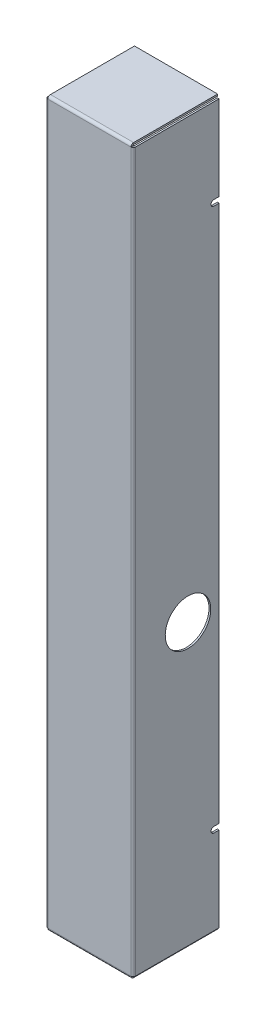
ISO-10303-21;
HEADER;
FILE_DESCRIPTION(('STEP AP214'),'2;1');
FILE_NAME('part.step','',(''),(''),'','','');
FILE_SCHEMA(('AUTOMOTIVE_DESIGN { 1 0 10303 214 1 1 1 1 }'));
ENDSEC;
DATA;
#1=APPLICATION_CONTEXT('core data for automotive mechanical design processes');
#2=APPLICATION_PROTOCOL_DEFINITION('international standard','automotive_design',2000,#1);
#3=PRODUCT_CONTEXT('',#1,'mechanical');
#4=PRODUCT('Part','Part','',(#3));
#5=PRODUCT_RELATED_PRODUCT_CATEGORY('part','',(#4));
#6=PRODUCT_DEFINITION_FORMATION('','',#4);
#7=PRODUCT_DEFINITION_CONTEXT('part definition',#1,'design');
#8=PRODUCT_DEFINITION('design','',#6,#7);
#9=PRODUCT_DEFINITION_SHAPE('','',#8);
#10=(LENGTH_UNIT() NAMED_UNIT(*) SI_UNIT(.MILLI.,.METRE.));
#11=(NAMED_UNIT(*) PLANE_ANGLE_UNIT() SI_UNIT($,.RADIAN.));
#12=(NAMED_UNIT(*) SI_UNIT($,.STERADIAN.) SOLID_ANGLE_UNIT());
#13=UNCERTAINTY_MEASURE_WITH_UNIT(LENGTH_MEASURE(1.E-05),#10,'distance_accuracy_value','');
#14=(GEOMETRIC_REPRESENTATION_CONTEXT(3) GLOBAL_UNCERTAINTY_ASSIGNED_CONTEXT((#13)) GLOBAL_UNIT_ASSIGNED_CONTEXT((#10,
#11,#12)) REPRESENTATION_CONTEXT('',''));
#15=CARTESIAN_POINT('',(0.,0.,0.));
#16=DIRECTION('',(0.,0.,1.));
#17=DIRECTION('',(1.,0.,0.));
#18=AXIS2_PLACEMENT_3D('',#15,#16,#17);
#19=CARTESIAN_POINT('',(-1.95619449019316,2.00000000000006,-3.39355279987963E-13));
#20=DIRECTION('',(0.,0.,-1.));
#21=DIRECTION('',(-1.,0.,0.));
#22=AXIS2_PLACEMENT_3D('',#19,#20,#21);
#23=PLANE('',#22);
#24=DIRECTION('',(-1.,0.,0.));
#25=VECTOR('',#24,1.);
#26=CARTESIAN_POINT('',(1.04380564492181,-717.75,0.));
#27=LINE('',#26,#25);
#28=CARTESIAN_POINT('',(1.04380564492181,-717.75,0.));
#29=VERTEX_POINT('',#28);
#30=CARTESIAN_POINT('',(-0.956194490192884,-717.75,0.));
#31=VERTEX_POINT('',#30);
#32=EDGE_CURVE('E333',#29,#31,#27,.T.);
#33=ORIENTED_EDGE('',*,*,#32,.T.);
#34=DIRECTION('',(0.,-1.,0.));
#35=VECTOR('',#34,1.);
#36=CARTESIAN_POINT('',(-0.956194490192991,0.,-3.42607886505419E-13));
#37=LINE('',#36,#35);
#38=CARTESIAN_POINT('',(-0.956194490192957,-104.25,0.));
#39=VERTEX_POINT('',#38);
#40=EDGE_CURVE('E464',#39,#31,#37,.T.);
#41=ORIENTED_EDGE('',*,*,#40,.F.);
#42=DIRECTION('',(-1.,0.,0.));
#43=VECTOR('',#42,1.);
#44=CARTESIAN_POINT('',(1.04380564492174,-104.25,0.));
#45=LINE('',#44,#43);
#46=CARTESIAN_POINT('',(1.04380564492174,-104.25,0.));
#47=VERTEX_POINT('',#46);
#48=EDGE_CURVE('E384',#47,#39,#45,.T.);
#49=ORIENTED_EDGE('',*,*,#48,.F.);
#50=DIRECTION('',(0.,-1.,0.));
#51=VECTOR('',#50,1.);
#52=CARTESIAN_POINT('',(1.04380550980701,0.,-3.49546780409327E-13));
#53=LINE('',#52,#51);
#54=EDGE_CURVE('E472',#47,#29,#53,.T.);
#55=ORIENTED_EDGE('',*,*,#54,.T.);
#56=EDGE_LOOP('',(#33,#41,#49,#55));
#57=FACE_BOUND('',#56,.T.);
#58=ADVANCED_FACE('F40',(#57),#23,.T.);
#59=CARTESIAN_POINT('',(-95.9999999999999,-824.,0.));
#60=DIRECTION('',(0.,0.,-1.));
#61=DIRECTION('',(-1.,0.,0.));
#62=AXIS2_PLACEMENT_3D('',#59,#60,#61);
#63=PLANE('',#62);
#64=CARTESIAN_POINT('',(-96.9999999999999,-717.75,0.));
#65=VERTEX_POINT('',#64);
#66=CARTESIAN_POINT('',(-98.9999999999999,-717.75,0.));
#67=VERTEX_POINT('',#66);
#68=EDGE_CURVE('E337',#65,#67,#27,.T.);
#69=ORIENTED_EDGE('',*,*,#68,.T.);
#70=DIRECTION('',(0.,-1.,0.));
#71=VECTOR('',#70,1.);
#72=CARTESIAN_POINT('',(-99.,0.,0.));
#73=LINE('',#72,#71);
#74=CARTESIAN_POINT('',(-99.,-104.25,0.));
#75=VERTEX_POINT('',#74);
#76=EDGE_CURVE('E421',#75,#67,#73,.T.);
#77=ORIENTED_EDGE('',*,*,#76,.F.);
#78=CARTESIAN_POINT('',(-97.,-104.25,0.));
#79=VERTEX_POINT('',#78);
#80=EDGE_CURVE('E370',#79,#75,#45,.T.);
#81=ORIENTED_EDGE('',*,*,#80,.F.);
#82=DIRECTION('',(0.,-1.,0.));
#83=VECTOR('',#82,1.);
#84=CARTESIAN_POINT('',(-97.,0.,0.));
#85=LINE('',#84,#83);
#86=EDGE_CURVE('E443',#79,#65,#85,.T.);
#87=ORIENTED_EDGE('',*,*,#86,.T.);
#88=EDGE_LOOP('',(#69,#77,#81,#87));
#89=FACE_BOUND('',#88,.T.);
#90=ADVANCED_FACE('F694',(#89),#63,.T.);
#91=DIRECTION('',(-1.,0.,0.));
#92=VECTOR('',#91,1.);
#93=CARTESIAN_POINT('',(1.04380564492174,-97.75,0.));
#94=LINE('',#93,#92);
#95=CARTESIAN_POINT('',(1.04380564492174,-97.75,0.));
#96=VERTEX_POINT('',#95);
#97=CARTESIAN_POINT('',(-0.956194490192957,-97.75,0.));
#98=VERTEX_POINT('',#97);
#99=EDGE_CURVE('E371',#96,#98,#94,.T.);
#100=ORIENTED_EDGE('',*,*,#99,.T.);
#101=CARTESIAN_POINT('',(-0.956194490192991,-0.999999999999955,-3.42499466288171E-13));
#102=VERTEX_POINT('',#101);
#103=EDGE_CURVE('E461',#102,#98,#37,.T.);
#104=ORIENTED_EDGE('',*,*,#103,.F.);
#105=DIRECTION('',(1.,0.,0.));
#106=VECTOR('',#105,1.);
#107=CARTESIAN_POINT('',(-0.956194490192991,-0.999999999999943,-3.42499466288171E-13));
#108=LINE('',#107,#106);
#109=CARTESIAN_POINT('',(1.04380550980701,-0.99999999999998,-3.49438360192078E-13));
#110=VERTEX_POINT('',#109);
#111=EDGE_CURVE('E474',#102,#110,#108,.T.);
#112=ORIENTED_EDGE('',*,*,#111,.T.);
#113=EDGE_CURVE('E469',#110,#96,#53,.T.);
#114=ORIENTED_EDGE('',*,*,#113,.T.);
#115=EDGE_LOOP('',(#100,#104,#112,#114));
#116=FACE_BOUND('',#115,.T.);
#117=ADVANCED_FACE('F715',(#116),#23,.T.);
#118=CARTESIAN_POINT('',(-97.,-97.75,0.));
#119=VERTEX_POINT('',#118);
#120=CARTESIAN_POINT('',(-99.,-97.75,0.));
#121=VERTEX_POINT('',#120);
#122=EDGE_CURVE('E375',#119,#121,#94,.T.);
#123=ORIENTED_EDGE('',*,*,#122,.T.);
#124=CARTESIAN_POINT('',(-99.,-1.00000000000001,0.));
#125=VERTEX_POINT('',#124);
#126=EDGE_CURVE('E418',#125,#121,#73,.T.);
#127=ORIENTED_EDGE('',*,*,#126,.F.);
#128=DIRECTION('',(1.,0.,0.));
#129=VECTOR('',#128,1.);
#130=CARTESIAN_POINT('',(-99.,-1.00000000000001,0.));
#131=LINE('',#130,#129);
#132=CARTESIAN_POINT('',(-97.,-1.00000000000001,0.));
#133=VERTEX_POINT('',#132);
#134=EDGE_CURVE('E434',#125,#133,#131,.T.);
#135=ORIENTED_EDGE('',*,*,#134,.T.);
#136=EDGE_CURVE('E440',#133,#119,#85,.T.);
#137=ORIENTED_EDGE('',*,*,#136,.T.);
#138=EDGE_LOOP('',(#123,#127,#135,#137));
#139=FACE_BOUND('',#138,.T.);
#140=ADVANCED_FACE('F677',(#139),#63,.T.);
#141=CARTESIAN_POINT('',(96.5219027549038,0.,98.1219027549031));
#142=DIRECTION('',(0.,0.,-1.));
#143=DIRECTION('',(0.,1.,0.));
#144=AXIS2_PLACEMENT_3D('',#141,#142,#143);
#145=PLANE('',#144);
#146=DIRECTION('',(-1.,0.,0.));
#147=VECTOR('',#146,1.);
#148=CARTESIAN_POINT('',(96.5219027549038,-0.999999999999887,98.1219027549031));
#149=LINE('',#148,#147);
#150=CARTESIAN_POINT('',(-96.4780972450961,-0.999999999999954,98.1219027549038));
#151=VERTEX_POINT('',#150);
#152=CARTESIAN_POINT('',(-96.5,-0.99999999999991,98.1219027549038));
#153=VERTEX_POINT('',#152);
#154=EDGE_CURVE('E544',#151,#153,#149,.T.);
#155=ORIENTED_EDGE('',*,*,#154,.T.);
#156=DIRECTION('',(0.,-1.,0.));
#157=VECTOR('',#156,1.);
#158=CARTESIAN_POINT('',(-96.5,0.,98.1219027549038));
#159=LINE('',#158,#157);
#160=CARTESIAN_POINT('',(-96.4999999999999,-821.,98.1219027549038));
#161=VERTEX_POINT('',#160);
#162=EDGE_CURVE('E49',#153,#161,#159,.T.);
#163=ORIENTED_EDGE('',*,*,#162,.T.);
#164=DIRECTION('',(-1.,0.,0.));
#165=VECTOR('',#164,1.);
#166=CARTESIAN_POINT('',(96.5219027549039,-821.,98.1219027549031));
#167=LINE('',#166,#165);
#168=CARTESIAN_POINT('',(-96.478097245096,-821.,98.1219027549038));
#169=VERTEX_POINT('',#168);
#170=EDGE_CURVE('E519',#161,#169,#167,.F.);
#171=ORIENTED_EDGE('',*,*,#170,.T.);
#172=DIRECTION('',(-1.,0.,0.));
#173=VECTOR('',#172,1.);
#174=CARTESIAN_POINT('',(96.5219027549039,-821.,98.1219027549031));
#175=LINE('',#174,#173);
#176=CARTESIAN_POINT('',(-1.47809724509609,-821.,98.1219027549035));
#177=VERTEX_POINT('',#176);
#178=EDGE_CURVE('E580',#177,#169,#175,.T.);
#179=ORIENTED_EDGE('',*,*,#178,.F.);
#180=CARTESIAN_POINT('',(-1.45619449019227,-821.,98.1219027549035));
#181=VERTEX_POINT('',#180);
#182=EDGE_CURVE('E617',#181,#177,#175,.T.);
#183=ORIENTED_EDGE('',*,*,#182,.F.);
#184=DIRECTION('',(0.,-1.,0.));
#185=VECTOR('',#184,1.);
#186=CARTESIAN_POINT('',(-1.45619449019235,0.,98.1219027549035));
#187=LINE('',#186,#185);
#188=CARTESIAN_POINT('',(-1.45619449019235,-0.999999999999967,98.1219028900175));
#189=VERTEX_POINT('',#188);
#190=EDGE_CURVE('E608',#189,#181,#187,.T.);
#191=ORIENTED_EDGE('',*,*,#190,.F.);
#192=DIRECTION('',(-1.,0.,0.));
#193=VECTOR('',#192,1.);
#194=CARTESIAN_POINT('',(96.5219027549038,-0.999999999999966,98.1219027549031));
#195=LINE('',#194,#193);
#196=CARTESIAN_POINT('',(-1.47809724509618,-0.999999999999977,98.1219027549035));
#197=VERTEX_POINT('',#196);
#198=EDGE_CURVE('E585',#189,#197,#195,.T.);
#199=ORIENTED_EDGE('',*,*,#198,.T.);
#200=EDGE_CURVE('E618',#197,#151,#195,.T.);
#201=ORIENTED_EDGE('',*,*,#200,.T.);
#202=EDGE_LOOP('',(#155,#163,#171,#179,#183,#191,#199,#201));
#203=FACE_BOUND('',#202,.T.);
#204=ADVANCED_FACE('F638',(#203),#145,.F.);
#205=CARTESIAN_POINT('',(96.5219027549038,0.,96.1219027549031));
#206=DIRECTION('',(0.,0.,-1.));
#207=DIRECTION('',(0.,1.,0.));
#208=AXIS2_PLACEMENT_3D('',#205,#206,#207);
#209=PLANE('',#208);
#210=DIRECTION('',(0.,-1.,0.));
#211=VECTOR('',#210,1.);
#212=CARTESIAN_POINT('',(-96.5,0.,96.1219027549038));
#213=LINE('',#212,#211);
#214=CARTESIAN_POINT('',(-96.5,-0.999999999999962,96.1219027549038));
#215=VERTEX_POINT('',#214);
#216=CARTESIAN_POINT('',(-96.4999999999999,-821.,96.1219028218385));
#217=VERTEX_POINT('',#216);
#218=EDGE_CURVE('E614',#215,#217,#213,.T.);
#219=ORIENTED_EDGE('',*,*,#218,.F.);
#220=DIRECTION('',(-1.,0.,0.));
#221=VECTOR('',#220,1.);
#222=CARTESIAN_POINT('',(96.5219027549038,-0.999999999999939,96.1219027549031));
#223=LINE('',#222,#221);
#224=CARTESIAN_POINT('',(-96.4780972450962,-0.999999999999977,96.1219027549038));
#225=VERTEX_POINT('',#224);
#226=EDGE_CURVE('E540',#225,#215,#223,.T.);
#227=ORIENTED_EDGE('',*,*,#226,.F.);
#228=DIRECTION('',(-1.,0.,0.));
#229=VECTOR('',#228,1.);
#230=CARTESIAN_POINT('',(96.5219027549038,-0.999999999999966,96.1219027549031));
#231=LINE('',#230,#229);
#232=CARTESIAN_POINT('',(-1.47809724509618,-0.999999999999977,96.1219027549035));
#233=VERTEX_POINT('',#232);
#234=EDGE_CURVE('E594',#233,#225,#231,.T.);
#235=ORIENTED_EDGE('',*,*,#234,.F.);
#236=CARTESIAN_POINT('',(-1.45619449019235,-0.999999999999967,96.1219028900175));
#237=VERTEX_POINT('',#236);
#238=EDGE_CURVE('E623',#237,#233,#231,.T.);
#239=ORIENTED_EDGE('',*,*,#238,.F.);
#240=DIRECTION('',(0.,-1.,0.));
#241=VECTOR('',#240,1.);
#242=CARTESIAN_POINT('',(-1.45619449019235,0.,96.1219027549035));
#243=LINE('',#242,#241);
#244=CARTESIAN_POINT('',(-1.45619449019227,-821.,96.1219028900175));
#245=VERTEX_POINT('',#244);
#246=EDGE_CURVE('E602',#237,#245,#243,.T.);
#247=ORIENTED_EDGE('',*,*,#246,.T.);
#248=DIRECTION('',(-1.,0.,0.));
#249=VECTOR('',#248,1.);
#250=CARTESIAN_POINT('',(96.5219027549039,-821.,96.1219027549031));
#251=LINE('',#250,#249);
#252=CARTESIAN_POINT('',(-1.47809724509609,-821.,96.1219027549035));
#253=VERTEX_POINT('',#252);
#254=EDGE_CURVE('E598',#245,#253,#251,.T.);
#255=ORIENTED_EDGE('',*,*,#254,.T.);
#256=CARTESIAN_POINT('',(-96.4780972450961,-821.,96.1219027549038));
#257=VERTEX_POINT('',#256);
#258=EDGE_CURVE('E624',#253,#257,#251,.T.);
#259=ORIENTED_EDGE('',*,*,#258,.T.);
#260=DIRECTION('',(1.,0.,0.));
#261=VECTOR('',#260,1.);
#262=CARTESIAN_POINT('',(96.5219027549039,-821.,96.1219027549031));
#263=LINE('',#262,#261);
#264=EDGE_CURVE('E44',#217,#257,#263,.T.);
#265=ORIENTED_EDGE('',*,*,#264,.F.);
#266=EDGE_LOOP('',(#219,#227,#235,#239,#247,#255,#259,#265));
#267=FACE_BOUND('',#266,.T.);
#268=ADVANCED_FACE('F780',(#267),#209,.T.);
#269=CARTESIAN_POINT('',(47.5219027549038,-0.999999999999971,96.1219027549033));
#270=DIRECTION('',(0.,1.,0.));
#271=DIRECTION('',(-1.,0.,0.));
#272=AXIS2_PLACEMENT_3D('',#269,#270,#271);
#273=PLANE('',#272);
#274=ORIENTED_EDGE('',*,*,#198,.F.);
#275=DIRECTION('',(0.,0.,-1.));
#276=VECTOR('',#275,1.);
#277=CARTESIAN_POINT('',(-1.45619449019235,-0.999999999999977,96.1219027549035));
#278=LINE('',#277,#276);
#279=EDGE_CURVE('E605',#189,#237,#278,.T.);
#280=ORIENTED_EDGE('',*,*,#279,.T.);
#281=ORIENTED_EDGE('',*,*,#238,.T.);
#282=DIRECTION('',(0.,0.,-1.));
#283=VECTOR('',#282,1.);
#284=CARTESIAN_POINT('',(-1.47809724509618,-0.999999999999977,96.1219027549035));
#285=LINE('',#284,#283);
#286=EDGE_CURVE('E564',#233,#197,#285,.F.);
#287=ORIENTED_EDGE('',*,*,#286,.T.);
#288=EDGE_LOOP('',(#274,#280,#281,#287));
#289=FACE_BOUND('',#288,.T.);
#290=ADVANCED_FACE('F784',(#289),#273,.T.);
#291=CARTESIAN_POINT('',(47.5219027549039,-821.,96.1219027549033));
#292=DIRECTION('',(0.,1.,0.));
#293=DIRECTION('',(-1.,0.,0.));
#294=AXIS2_PLACEMENT_3D('',#291,#292,#293);
#295=PLANE('',#294);
#296=ORIENTED_EDGE('',*,*,#254,.F.);
#297=DIRECTION('',(0.,0.,1.));
#298=VECTOR('',#297,1.);
#299=CARTESIAN_POINT('',(-1.45619449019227,-821.,96.1219027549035));
#300=LINE('',#299,#298);
#301=EDGE_CURVE('E611',#245,#181,#300,.T.);
#302=ORIENTED_EDGE('',*,*,#301,.T.);
#303=ORIENTED_EDGE('',*,*,#182,.T.);
#304=DIRECTION('',(0.,0.,-1.));
#305=VECTOR('',#304,1.);
#306=CARTESIAN_POINT('',(-1.47809724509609,-821.,96.1219027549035));
#307=LINE('',#306,#305);
#308=EDGE_CURVE('E501',#253,#177,#307,.F.);
#309=ORIENTED_EDGE('',*,*,#308,.F.);
#310=EDGE_LOOP('',(#296,#302,#303,#309));
#311=FACE_BOUND('',#310,.T.);
#312=ADVANCED_FACE('F775',(#311),#295,.F.);
#313=CARTESIAN_POINT('',(96.5219027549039,-824.,96.1219027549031));
#314=DIRECTION('',(0.,1.,0.));
#315=DIRECTION('',(1.,0.,0.));
#316=AXIS2_PLACEMENT_3D('',#313,#314,#315);
#317=PLANE('',#316);
#318=DIRECTION('',(0.,0.,-1.));
#319=VECTOR('',#318,1.);
#320=CARTESIAN_POINT('',(-1.47809724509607,-824.,96.1219027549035));
#321=LINE('',#320,#319);
#322=CARTESIAN_POINT('',(-1.4780972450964,-824.,-0.878097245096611));
#323=VERTEX_POINT('',#322);
#324=CARTESIAN_POINT('',(-1.47809724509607,-824.,95.1219027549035));
#325=VERTEX_POINT('',#324);
#326=EDGE_CURVE('E507',#323,#325,#321,.F.);
#327=ORIENTED_EDGE('',*,*,#326,.T.);
#328=DIRECTION('',(-1.,0.,0.));
#329=VECTOR('',#328,1.);
#330=CARTESIAN_POINT('',(96.5219027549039,-824.,95.1219027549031));
#331=LINE('',#330,#329);
#332=CARTESIAN_POINT('',(-96.4780972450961,-824.,95.1219027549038));
#333=VERTEX_POINT('',#332);
#334=EDGE_CURVE('E576',#325,#333,#331,.T.);
#335=ORIENTED_EDGE('',*,*,#334,.T.);
#336=DIRECTION('',(0.,0.,-1.));
#337=VECTOR('',#336,1.);
#338=CARTESIAN_POINT('',(-96.4780972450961,-824.,96.1219027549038));
#339=LINE('',#338,#337);
#340=CARTESIAN_POINT('',(-96.4780972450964,-824.,-0.87809724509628));
#341=VERTEX_POINT('',#340);
#342=EDGE_CURVE('E529',#333,#341,#339,.T.);
#343=ORIENTED_EDGE('',*,*,#342,.T.);
#344=DIRECTION('',(-1.,0.,0.));
#345=VECTOR('',#344,1.);
#346=CARTESIAN_POINT('',(96.5219027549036,-824.,-0.878097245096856));
#347=LINE('',#346,#345);
#348=EDGE_CURVE('E600',#323,#341,#347,.T.);
#349=ORIENTED_EDGE('',*,*,#348,.F.);
#350=EDGE_LOOP('',(#327,#335,#343,#349));
#351=FACE_BOUND('',#350,.T.);
#352=ADVANCED_FACE('F1116',(#351),#317,.F.);
#353=CARTESIAN_POINT('',(96.5219027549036,-822.,-0.87809724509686));
#354=DIRECTION('',(0.,0.,-1.));
#355=DIRECTION('',(0.,1.,0.));
#356=AXIS2_PLACEMENT_3D('',#353,#354,#355);
#357=PLANE('',#356);
#358=DIRECTION('',(-1.,0.,0.));
#359=VECTOR('',#358,1.);
#360=CARTESIAN_POINT('',(96.5219027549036,-822.,-0.87809724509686));
#361=LINE('',#360,#359);
#362=CARTESIAN_POINT('',(-1.4780972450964,-822.,-0.878097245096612));
#363=VERTEX_POINT('',#362);
#364=CARTESIAN_POINT('',(-96.4780972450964,-822.,-0.87809724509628));
#365=VERTEX_POINT('',#364);
#366=EDGE_CURVE('E597',#363,#365,#361,.T.);
#367=ORIENTED_EDGE('',*,*,#366,.F.);
#368=DIRECTION('',(0.,1.,0.));
#369=VECTOR('',#368,1.);
#370=CARTESIAN_POINT('',(-1.4780972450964,-822.,-0.878097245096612));
#371=LINE('',#370,#369);
#372=EDGE_CURVE('E510',#363,#323,#371,.F.);
#373=ORIENTED_EDGE('',*,*,#372,.T.);
#374=ORIENTED_EDGE('',*,*,#348,.T.);
#375=DIRECTION('',(0.,1.,0.));
#376=VECTOR('',#375,1.);
#377=CARTESIAN_POINT('',(-96.4780972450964,-822.,-0.87809724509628));
#378=LINE('',#377,#376);
#379=EDGE_CURVE('E533',#365,#341,#378,.F.);
#380=ORIENTED_EDGE('',*,*,#379,.F.);
#381=EDGE_LOOP('',(#367,#373,#374,#380));
#382=FACE_BOUND('',#381,.T.);
#383=ADVANCED_FACE('F1222',(#382),#357,.T.);
#384=CARTESIAN_POINT('',(96.5219027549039,-822.,96.1219027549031));
#385=DIRECTION('',(0.,1.,0.));
#386=DIRECTION('',(1.,0.,0.));
#387=AXIS2_PLACEMENT_3D('',#384,#385,#386);
#388=PLANE('',#387);
#389=DIRECTION('',(-1.,0.,0.));
#390=VECTOR('',#389,1.);
#391=CARTESIAN_POINT('',(96.5219027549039,-822.,95.1219027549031));
#392=LINE('',#391,#390);
#393=CARTESIAN_POINT('',(-1.47809724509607,-822.,95.1219027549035));
#394=VERTEX_POINT('',#393);
#395=CARTESIAN_POINT('',(-96.4780972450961,-822.,95.1219027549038));
#396=VERTEX_POINT('',#395);
#397=EDGE_CURVE('E595',#394,#396,#392,.T.);
#398=ORIENTED_EDGE('',*,*,#397,.F.);
#399=DIRECTION('',(0.,0.,1.));
#400=VECTOR('',#399,1.);
#401=CARTESIAN_POINT('',(-1.47809724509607,-822.,96.1219027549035));
#402=LINE('',#401,#400);
#403=EDGE_CURVE('E504',#363,#394,#402,.T.);
#404=ORIENTED_EDGE('',*,*,#403,.F.);
#405=ORIENTED_EDGE('',*,*,#366,.T.);
#406=DIRECTION('',(0.,0.,-1.));
#407=VECTOR('',#406,1.);
#408=CARTESIAN_POINT('',(-96.4780972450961,-822.,96.1219027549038));
#409=LINE('',#408,#407);
#410=EDGE_CURVE('E526',#396,#365,#409,.T.);
#411=ORIENTED_EDGE('',*,*,#410,.F.);
#412=EDGE_LOOP('',(#398,#404,#405,#411));
#413=FACE_BOUND('',#412,.T.);
#414=ADVANCED_FACE('F1232',(#413),#388,.T.);
#415=CARTESIAN_POINT('',(96.5219027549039,-821.,95.1219027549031));
#416=DIRECTION('',(-1.,0.,0.));
#417=DIRECTION('',(0.,0.,1.));
#418=AXIS2_PLACEMENT_3D('',#415,#416,#417);
#419=CYLINDRICAL_SURFACE('',#418,1.);
#420=ORIENTED_EDGE('',*,*,#258,.F.);
#421=CARTESIAN_POINT('',(-1.47809724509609,-821.,95.1219027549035));
#422=DIRECTION('',(-1.,0.,0.));
#423=DIRECTION('',(0.,0.,1.));
#424=AXIS2_PLACEMENT_3D('',#421,#422,#423);
#425=CIRCLE('',#424,1.);
#426=EDGE_CURVE('E495',#394,#253,#425,.T.);
#427=ORIENTED_EDGE('',*,*,#426,.F.);
#428=ORIENTED_EDGE('',*,*,#397,.T.);
#429=CARTESIAN_POINT('',(-96.4780972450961,-821.,95.1219027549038));
#430=DIRECTION('',(1.,0.,0.));
#431=DIRECTION('',(0.,0.,-1.));
#432=AXIS2_PLACEMENT_3D('',#429,#430,#431);
#433=CIRCLE('',#432,1.);
#434=EDGE_CURVE('E516',#257,#396,#433,.T.);
#435=ORIENTED_EDGE('',*,*,#434,.F.);
#436=EDGE_LOOP('',(#420,#427,#428,#435));
#437=FACE_BOUND('',#436,.T.);
#438=ADVANCED_FACE('F1242',(#437),#419,.F.);
#439=CARTESIAN_POINT('',(96.5219027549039,-821.,95.1219027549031));
#440=DIRECTION('',(-1.,0.,0.));
#441=DIRECTION('',(0.,0.,1.));
#442=AXIS2_PLACEMENT_3D('',#439,#440,#441);
#443=CYLINDRICAL_SURFACE('',#442,3.);
#444=CARTESIAN_POINT('',(-1.47809724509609,-821.,95.1219027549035));
#445=DIRECTION('',(-1.,0.,0.));
#446=DIRECTION('',(0.,0.,1.));
#447=AXIS2_PLACEMENT_3D('',#444,#445,#446);
#448=CIRCLE('',#447,3.);
#449=EDGE_CURVE('E498',#325,#177,#448,.T.);
#450=ORIENTED_EDGE('',*,*,#449,.T.);
#451=ORIENTED_EDGE('',*,*,#178,.T.);
#452=CARTESIAN_POINT('',(-96.4780972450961,-821.,95.1219027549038));
#453=DIRECTION('',(-1.,0.,0.));
#454=DIRECTION('',(0.,0.,1.));
#455=AXIS2_PLACEMENT_3D('',#452,#453,#454);
#456=CIRCLE('',#455,3.);
#457=EDGE_CURVE('E520',#169,#333,#456,.F.);
#458=ORIENTED_EDGE('',*,*,#457,.T.);
#459=ORIENTED_EDGE('',*,*,#334,.F.);
#460=EDGE_LOOP('',(#450,#451,#458,#459));
#461=FACE_BOUND('',#460,.T.);
#462=ADVANCED_FACE('F1252',(#461),#443,.T.);
#463=CARTESIAN_POINT('',(96.5219027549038,-0.999999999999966,95.1219027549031));
#464=DIRECTION('',(-1.,0.,0.));
#465=DIRECTION('',(0.,0.,1.));
#466=AXIS2_PLACEMENT_3D('',#463,#464,#465);
#467=CYLINDRICAL_SURFACE('',#466,1.);
#468=ORIENTED_EDGE('',*,*,#234,.T.);
#469=CARTESIAN_POINT('',(-96.4780972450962,-0.999999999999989,95.1219027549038));
#470=DIRECTION('',(1.,0.,0.));
#471=DIRECTION('',(0.,0.,-1.));
#472=AXIS2_PLACEMENT_3D('',#469,#470,#471);
#473=CIRCLE('',#472,1.);
#474=CARTESIAN_POINT('',(-96.4780972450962,0.,95.1219027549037));
#475=VERTEX_POINT('',#474);
#476=EDGE_CURVE('E536',#475,#225,#473,.T.);
#477=ORIENTED_EDGE('',*,*,#476,.F.);
#478=DIRECTION('',(-1.,0.,0.));
#479=VECTOR('',#478,1.);
#480=CARTESIAN_POINT('',(96.5219027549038,0.,95.1219027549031));
#481=LINE('',#480,#479);
#482=CARTESIAN_POINT('',(-1.47809724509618,0.,95.1219027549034));
#483=VERTEX_POINT('',#482);
#484=EDGE_CURVE('E591',#483,#475,#481,.T.);
#485=ORIENTED_EDGE('',*,*,#484,.F.);
#486=CARTESIAN_POINT('',(-1.47809724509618,-0.999999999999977,95.1219027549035));
#487=DIRECTION('',(-1.,0.,0.));
#488=DIRECTION('',(0.,0.,1.));
#489=AXIS2_PLACEMENT_3D('',#486,#487,#488);
#490=CIRCLE('',#489,1.);
#491=EDGE_CURVE('E557',#233,#483,#490,.T.);
#492=ORIENTED_EDGE('',*,*,#491,.F.);
#493=EDGE_LOOP('',(#468,#477,#485,#492));
#494=FACE_BOUND('',#493,.T.);
#495=ADVANCED_FACE('F1262',(#494),#467,.F.);
#496=CARTESIAN_POINT('',(96.5219027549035,0.,-0.878097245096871));
#497=DIRECTION('',(0.,-1.,0.));
#498=DIRECTION('',(0.,0.,-1.));
#499=AXIS2_PLACEMENT_3D('',#496,#497,#498);
#500=PLANE('',#499);
#501=ORIENTED_EDGE('',*,*,#484,.T.);
#502=DIRECTION('',(0.,0.,1.));
#503=VECTOR('',#502,1.);
#504=CARTESIAN_POINT('',(-96.4780972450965,0.,-0.878097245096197));
#505=LINE('',#504,#503);
#506=CARTESIAN_POINT('',(-96.4780972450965,0.,-0.87809724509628));
#507=VERTEX_POINT('',#506);
#508=EDGE_CURVE('E548',#507,#475,#505,.T.);
#509=ORIENTED_EDGE('',*,*,#508,.F.);
#510=DIRECTION('',(-1.,0.,0.));
#511=VECTOR('',#510,1.);
#512=CARTESIAN_POINT('',(96.5219027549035,0.,-0.878097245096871));
#513=LINE('',#512,#511);
#514=CARTESIAN_POINT('',(-1.47809724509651,0.,-0.878097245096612));
#515=VERTEX_POINT('',#514);
#516=EDGE_CURVE('E588',#515,#507,#513,.T.);
#517=ORIENTED_EDGE('',*,*,#516,.F.);
#518=DIRECTION('',(0.,0.,-1.));
#519=VECTOR('',#518,1.);
#520=CARTESIAN_POINT('',(-1.47809724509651,0.,-0.878097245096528));
#521=LINE('',#520,#519);
#522=EDGE_CURVE('E570',#483,#515,#521,.T.);
#523=ORIENTED_EDGE('',*,*,#522,.F.);
#524=EDGE_LOOP('',(#501,#509,#517,#523));
#525=FACE_BOUND('',#524,.T.);
#526=ADVANCED_FACE('F1272',(#525),#500,.T.);
#527=CARTESIAN_POINT('',(96.5219027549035,2.00000000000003,-0.878097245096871));
#528=DIRECTION('',(0.,0.,-1.));
#529=DIRECTION('',(0.,1.,0.));
#530=AXIS2_PLACEMENT_3D('',#527,#528,#529);
#531=PLANE('',#530);
#532=ORIENTED_EDGE('',*,*,#516,.T.);
#533=DIRECTION('',(0.,-1.,0.));
#534=VECTOR('',#533,1.);
#535=CARTESIAN_POINT('',(-96.4780972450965,0.,-0.87809724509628));
#536=LINE('',#535,#534);
#537=CARTESIAN_POINT('',(-96.4780972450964,2.00000000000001,-0.87809724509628));
#538=VERTEX_POINT('',#537);
#539=EDGE_CURVE('E553',#507,#538,#536,.F.);
#540=ORIENTED_EDGE('',*,*,#539,.T.);
#541=DIRECTION('',(-1.,0.,0.));
#542=VECTOR('',#541,1.);
#543=CARTESIAN_POINT('',(96.5219027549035,2.00000000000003,-0.878097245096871));
#544=LINE('',#543,#542);
#545=CARTESIAN_POINT('',(-1.47809724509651,2.00000000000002,-0.878097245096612));
#546=VERTEX_POINT('',#545);
#547=EDGE_CURVE('E584',#546,#538,#544,.T.);
#548=ORIENTED_EDGE('',*,*,#547,.F.);
#549=DIRECTION('',(0.,1.,0.));
#550=VECTOR('',#549,1.);
#551=CARTESIAN_POINT('',(-1.47809724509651,2.00000000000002,-0.878097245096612));
#552=LINE('',#551,#550);
#553=EDGE_CURVE('E573',#546,#515,#552,.F.);
#554=ORIENTED_EDGE('',*,*,#553,.T.);
#555=EDGE_LOOP('',(#532,#540,#548,#554));
#556=FACE_BOUND('',#555,.T.);
#557=ADVANCED_FACE('F1282',(#556),#531,.T.);
#558=CARTESIAN_POINT('',(96.5219027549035,2.00000000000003,-0.878097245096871));
#559=DIRECTION('',(0.,-1.,0.));
#560=DIRECTION('',(0.,0.,-1.));
#561=AXIS2_PLACEMENT_3D('',#558,#559,#560);
#562=PLANE('',#561);
#563=DIRECTION('',(0.,0.,-1.));
#564=VECTOR('',#563,1.);
#565=CARTESIAN_POINT('',(-96.4780972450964,2.00000000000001,-0.878097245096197));
#566=LINE('',#565,#564);
#567=CARTESIAN_POINT('',(-96.4780972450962,2.00000000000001,95.1219027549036));
#568=VERTEX_POINT('',#567);
#569=EDGE_CURVE('E550',#538,#568,#566,.F.);
#570=ORIENTED_EDGE('',*,*,#569,.T.);
#571=DIRECTION('',(-1.,0.,0.));
#572=VECTOR('',#571,1.);
#573=CARTESIAN_POINT('',(96.5219027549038,2.00000000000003,95.1219027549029));
#574=LINE('',#573,#572);
#575=CARTESIAN_POINT('',(-1.47809724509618,2.00000000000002,95.1219027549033));
#576=VERTEX_POINT('',#575);
#577=EDGE_CURVE('E581',#576,#568,#574,.T.);
#578=ORIENTED_EDGE('',*,*,#577,.F.);
#579=DIRECTION('',(0.,0.,-1.));
#580=VECTOR('',#579,1.);
#581=CARTESIAN_POINT('',(-1.47809724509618,2.00000000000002,98.1219027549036));
#582=LINE('',#581,#580);
#583=EDGE_CURVE('E567',#576,#546,#582,.T.);
#584=ORIENTED_EDGE('',*,*,#583,.T.);
#585=ORIENTED_EDGE('',*,*,#547,.T.);
#586=EDGE_LOOP('',(#570,#578,#584,#585));
#587=FACE_BOUND('',#586,.T.);
#588=ADVANCED_FACE('F1292',(#587),#562,.F.);
#589=CARTESIAN_POINT('',(96.5219027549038,-0.999999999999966,95.1219027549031));
#590=DIRECTION('',(-1.,0.,0.));
#591=DIRECTION('',(0.,0.,1.));
#592=AXIS2_PLACEMENT_3D('',#589,#590,#591);
#593=CYLINDRICAL_SURFACE('',#592,3.);
#594=CARTESIAN_POINT('',(-96.4780972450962,-0.999999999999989,95.1219027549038));
#595=DIRECTION('',(-1.,0.,0.));
#596=DIRECTION('',(0.,0.,1.));
#597=AXIS2_PLACEMENT_3D('',#594,#595,#596);
#598=CIRCLE('',#597,3.);
#599=EDGE_CURVE('E541',#568,#151,#598,.F.);
#600=ORIENTED_EDGE('',*,*,#599,.T.);
#601=ORIENTED_EDGE('',*,*,#200,.F.);
#602=CARTESIAN_POINT('',(-1.47809724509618,-0.999999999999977,95.1219027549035));
#603=DIRECTION('',(-1.,0.,0.));
#604=DIRECTION('',(0.,0.,1.));
#605=AXIS2_PLACEMENT_3D('',#602,#603,#604);
#606=CIRCLE('',#605,3.);
#607=EDGE_CURVE('E561',#197,#576,#606,.T.);
#608=ORIENTED_EDGE('',*,*,#607,.T.);
#609=ORIENTED_EDGE('',*,*,#577,.T.);
#610=EDGE_LOOP('',(#600,#601,#608,#609));
#611=FACE_BOUND('',#610,.T.);
#612=ADVANCED_FACE('F1212',(#611),#593,.T.);
#613=CARTESIAN_POINT('',(-1.47809724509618,2.00000000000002,98.1219027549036));
#614=DIRECTION('',(-1.,0.,0.));
#615=DIRECTION('',(0.,0.,-1.));
#616=AXIS2_PLACEMENT_3D('',#613,#614,#615);
#617=PLANE('',#616);
#618=ORIENTED_EDGE('',*,*,#553,.F.);
#619=ORIENTED_EDGE('',*,*,#583,.F.);
#620=DIRECTION('',(0.,1.,0.));
#621=VECTOR('',#620,1.);
#622=CARTESIAN_POINT('',(-1.47809724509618,2.00000000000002,95.1219027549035));
#623=LINE('',#622,#621);
#624=EDGE_CURVE('E572',#576,#483,#623,.F.);
#625=ORIENTED_EDGE('',*,*,#624,.T.);
#626=ORIENTED_EDGE('',*,*,#522,.T.);
#627=EDGE_LOOP('',(#618,#619,#625,#626));
#628=FACE_BOUND('',#627,.T.);
#629=ADVANCED_FACE('F1202',(#628),#617,.F.);
#630=CARTESIAN_POINT('',(-1.47809724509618,-0.999999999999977,95.1219027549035));
#631=DIRECTION('',(1.,0.,0.));
#632=DIRECTION('',(0.,0.,-1.));
#633=AXIS2_PLACEMENT_3D('',#630,#631,#632);
#634=PLANE('',#633);
#635=ORIENTED_EDGE('',*,*,#491,.T.);
#636=ORIENTED_EDGE('',*,*,#624,.F.);
#637=ORIENTED_EDGE('',*,*,#607,.F.);
#638=ORIENTED_EDGE('',*,*,#286,.F.);
#639=EDGE_LOOP('',(#635,#636,#637,#638));
#640=FACE_BOUND('',#639,.T.);
#641=ADVANCED_FACE('F1192',(#640),#634,.T.);
#642=CARTESIAN_POINT('',(-96.4780972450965,0.,-0.878097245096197));
#643=DIRECTION('',(1.,0.,0.));
#644=DIRECTION('',(0.,0.,1.));
#645=AXIS2_PLACEMENT_3D('',#642,#643,#644);
#646=PLANE('',#645);
#647=ORIENTED_EDGE('',*,*,#508,.T.);
#648=DIRECTION('',(0.,-1.,0.));
#649=VECTOR('',#648,1.);
#650=CARTESIAN_POINT('',(-96.4780972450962,0.,95.1219027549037));
#651=LINE('',#650,#649);
#652=EDGE_CURVE('E554',#475,#568,#651,.F.);
#653=ORIENTED_EDGE('',*,*,#652,.T.);
#654=ORIENTED_EDGE('',*,*,#569,.F.);
#655=ORIENTED_EDGE('',*,*,#539,.F.);
#656=EDGE_LOOP('',(#647,#653,#654,#655));
#657=FACE_BOUND('',#656,.T.);
#658=ADVANCED_FACE('F1184',(#657),#646,.F.);
#659=CARTESIAN_POINT('',(-145.478097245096,-0.999999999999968,96.121902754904));
#660=DIRECTION('',(0.,1.,0.));
#661=DIRECTION('',(-1.,0.,0.));
#662=AXIS2_PLACEMENT_3D('',#659,#660,#661);
#663=PLANE('',#662);
#664=DIRECTION('',(0.,0.,-1.));
#665=VECTOR('',#664,1.);
#666=CARTESIAN_POINT('',(-96.5,-0.999999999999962,96.1219027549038));
#667=LINE('',#666,#665);
#668=EDGE_CURVE('E12',#153,#215,#667,.T.);
#669=ORIENTED_EDGE('',*,*,#668,.F.);
#670=ORIENTED_EDGE('',*,*,#154,.F.);
#671=DIRECTION('',(0.,0.,-1.));
#672=VECTOR('',#671,1.);
#673=CARTESIAN_POINT('',(-96.4780972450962,-0.999999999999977,96.1219027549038));
#674=LINE('',#673,#672);
#675=EDGE_CURVE('E545',#225,#151,#674,.F.);
#676=ORIENTED_EDGE('',*,*,#675,.F.);
#677=ORIENTED_EDGE('',*,*,#226,.T.);
#678=EDGE_LOOP('',(#669,#670,#676,#677));
#679=FACE_BOUND('',#678,.T.);
#680=ADVANCED_FACE('F42',(#679),#663,.T.);
#681=CARTESIAN_POINT('',(-96.4780972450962,-0.999999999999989,95.1219027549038));
#682=DIRECTION('',(-1.,0.,0.));
#683=DIRECTION('',(0.,0.,1.));
#684=AXIS2_PLACEMENT_3D('',#681,#682,#683);
#685=PLANE('',#684);
#686=ORIENTED_EDGE('',*,*,#476,.T.);
#687=ORIENTED_EDGE('',*,*,#675,.T.);
#688=ORIENTED_EDGE('',*,*,#599,.F.);
#689=ORIENTED_EDGE('',*,*,#652,.F.);
#690=EDGE_LOOP('',(#686,#687,#688,#689));
#691=FACE_BOUND('',#690,.T.);
#692=ADVANCED_FACE('F1165',(#691),#685,.T.);
#693=CARTESIAN_POINT('',(-96.4780972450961,-822.,96.1219027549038));
#694=DIRECTION('',(1.,0.,0.));
#695=DIRECTION('',(0.,0.,-1.));
#696=AXIS2_PLACEMENT_3D('',#693,#694,#695);
#697=PLANE('',#696);
#698=ORIENTED_EDGE('',*,*,#410,.T.);
#699=ORIENTED_EDGE('',*,*,#379,.T.);
#700=ORIENTED_EDGE('',*,*,#342,.F.);
#701=DIRECTION('',(0.,1.,0.));
#702=VECTOR('',#701,1.);
#703=CARTESIAN_POINT('',(-96.4780972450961,-822.,95.1219027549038));
#704=LINE('',#703,#702);
#705=EDGE_CURVE('E532',#396,#333,#704,.F.);
#706=ORIENTED_EDGE('',*,*,#705,.F.);
#707=EDGE_LOOP('',(#698,#699,#700,#706));
#708=FACE_BOUND('',#707,.T.);
#709=ADVANCED_FACE('F1155',(#708),#697,.F.);
#710=CARTESIAN_POINT('',(-145.478097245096,-821.,96.121902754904));
#711=DIRECTION('',(0.,-1.,0.));
#712=DIRECTION('',(1.,0.,0.));
#713=AXIS2_PLACEMENT_3D('',#710,#711,#712);
#714=PLANE('',#713);
#715=DIRECTION('',(0.,0.,1.));
#716=VECTOR('',#715,1.);
#717=CARTESIAN_POINT('',(-96.4999999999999,-821.,96.1219027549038));
#718=LINE('',#717,#716);
#719=EDGE_CURVE('E629',#217,#161,#718,.T.);
#720=ORIENTED_EDGE('',*,*,#719,.F.);
#721=ORIENTED_EDGE('',*,*,#264,.T.);
#722=DIRECTION('',(0.,0.,-1.));
#723=VECTOR('',#722,1.);
#724=CARTESIAN_POINT('',(-96.4780972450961,-821.,96.1219027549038));
#725=LINE('',#724,#723);
#726=EDGE_CURVE('E523',#257,#169,#725,.F.);
#727=ORIENTED_EDGE('',*,*,#726,.T.);
#728=ORIENTED_EDGE('',*,*,#170,.F.);
#729=EDGE_LOOP('',(#720,#721,#727,#728));
#730=FACE_BOUND('',#729,.T.);
#731=ADVANCED_FACE('F1145',(#730),#714,.T.);
#732=CARTESIAN_POINT('',(-96.4780972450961,-821.,95.1219027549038));
#733=DIRECTION('',(-1.,0.,0.));
#734=DIRECTION('',(0.,0.,1.));
#735=AXIS2_PLACEMENT_3D('',#732,#733,#734);
#736=PLANE('',#735);
#737=ORIENTED_EDGE('',*,*,#434,.T.);
#738=ORIENTED_EDGE('',*,*,#705,.T.);
#739=ORIENTED_EDGE('',*,*,#457,.F.);
#740=ORIENTED_EDGE('',*,*,#726,.F.);
#741=EDGE_LOOP('',(#737,#738,#739,#740));
#742=FACE_BOUND('',#741,.T.);
#743=ADVANCED_FACE('F1135',(#742),#736,.T.);
#744=CARTESIAN_POINT('',(-1.47809724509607,-822.,96.1219027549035));
#745=DIRECTION('',(-1.,0.,0.));
#746=DIRECTION('',(0.,0.,1.));
#747=AXIS2_PLACEMENT_3D('',#744,#745,#746);
#748=PLANE('',#747);
#749=ORIENTED_EDGE('',*,*,#403,.T.);
#750=DIRECTION('',(0.,1.,0.));
#751=VECTOR('',#750,1.);
#752=CARTESIAN_POINT('',(-1.47809724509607,-822.,95.1219027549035));
#753=LINE('',#752,#751);
#754=EDGE_CURVE('E511',#394,#325,#753,.F.);
#755=ORIENTED_EDGE('',*,*,#754,.T.);
#756=ORIENTED_EDGE('',*,*,#326,.F.);
#757=ORIENTED_EDGE('',*,*,#372,.F.);
#758=EDGE_LOOP('',(#749,#755,#756,#757));
#759=FACE_BOUND('',#758,.T.);
#760=ADVANCED_FACE('F1125',(#759),#748,.F.);
#761=CARTESIAN_POINT('',(-1.47809724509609,-821.,95.1219027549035));
#762=DIRECTION('',(1.,0.,0.));
#763=DIRECTION('',(0.,0.,-1.));
#764=AXIS2_PLACEMENT_3D('',#761,#762,#763);
#765=PLANE('',#764);
#766=ORIENTED_EDGE('',*,*,#426,.T.);
#767=ORIENTED_EDGE('',*,*,#308,.T.);
#768=ORIENTED_EDGE('',*,*,#449,.F.);
#769=ORIENTED_EDGE('',*,*,#754,.F.);
#770=EDGE_LOOP('',(#766,#767,#768,#769));
#771=FACE_BOUND('',#770,.T.);
#772=ADVANCED_FACE('F1084',(#771),#765,.T.);
#773=CARTESIAN_POINT('',(-1.45619449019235,-0.999999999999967,95.6219026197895));
#774=DIRECTION('',(0.,-1.,0.));
#775=DIRECTION('',(-1.,0.,0.));
#776=AXIS2_PLACEMENT_3D('',#773,#774,#775);
#777=PLANE('',#776);
#778=ORIENTED_EDGE('',*,*,#279,.F.);
#779=CARTESIAN_POINT('',(-1.45619449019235,-0.999999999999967,95.6219027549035));
#780=DIRECTION('',(0.,-1.,0.));
#781=DIRECTION('',(0.,0.,-1.));
#782=AXIS2_PLACEMENT_3D('',#779,#780,#781);
#783=CIRCLE('',#782,2.50000013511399);
#784=CARTESIAN_POINT('',(1.04380550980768,-0.999999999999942,95.6219027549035));
#785=VERTEX_POINT('',#784);
#786=EDGE_CURVE('E449',#189,#785,#783,.F.);
#787=ORIENTED_EDGE('',*,*,#786,.T.);
#788=DIRECTION('',(-1.,0.,0.));
#789=VECTOR('',#788,1.);
#790=CARTESIAN_POINT('',(-0.956194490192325,-0.999999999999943,95.6219027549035));
#791=LINE('',#790,#789);
#792=CARTESIAN_POINT('',(-0.956194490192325,-0.999999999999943,95.6219027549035));
#793=VERTEX_POINT('',#792);
#794=EDGE_CURVE('E477',#785,#793,#791,.T.);
#795=ORIENTED_EDGE('',*,*,#794,.T.);
#796=CARTESIAN_POINT('',(-1.45619449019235,-0.999999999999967,95.6219026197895));
#797=DIRECTION('',(0.,1.,0.));
#798=DIRECTION('',(-1.,0.,0.));
#799=AXIS2_PLACEMENT_3D('',#796,#797,#798);
#800=CIRCLE('',#799,0.500000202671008);
#801=EDGE_CURVE('E489',#237,#793,#800,.T.);
#802=ORIENTED_EDGE('',*,*,#801,.F.);
#803=EDGE_LOOP('',(#778,#787,#795,#802));
#804=FACE_BOUND('',#803,.T.);
#805=ADVANCED_FACE('F786',(#804),#777,.F.);
#806=CARTESIAN_POINT('',(-1.45619449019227,-821.,95.6219026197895));
#807=DIRECTION('',(0.,1.,0.));
#808=DIRECTION('',(1.,0.,0.));
#809=AXIS2_PLACEMENT_3D('',#806,#807,#808);
#810=PLANE('',#809);
#811=CARTESIAN_POINT('',(-1.45619449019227,-821.,95.6219027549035));
#812=DIRECTION('',(0.,-1.,0.));
#813=DIRECTION('',(0.,0.,-1.));
#814=AXIS2_PLACEMENT_3D('',#811,#812,#813);
#815=CIRCLE('',#814,2.50000013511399);
#816=CARTESIAN_POINT('',(1.04380550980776,-821.,95.6219027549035));
#817=VERTEX_POINT('',#816);
#818=EDGE_CURVE('E487',#817,#181,#815,.T.);
#819=ORIENTED_EDGE('',*,*,#818,.T.);
#820=ORIENTED_EDGE('',*,*,#301,.F.);
#821=CARTESIAN_POINT('',(-1.45619449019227,-821.,95.6219026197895));
#822=DIRECTION('',(0.,-1.,0.));
#823=DIRECTION('',(-1.,0.,0.));
#824=AXIS2_PLACEMENT_3D('',#821,#822,#823);
#825=CIRCLE('',#824,0.500000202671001);
#826=CARTESIAN_POINT('',(-0.956194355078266,-821.,95.6219027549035));
#827=VERTEX_POINT('',#826);
#828=EDGE_CURVE('E492',#827,#245,#825,.T.);
#829=ORIENTED_EDGE('',*,*,#828,.F.);
#830=DIRECTION('',(1.,0.,0.));
#831=VECTOR('',#830,1.);
#832=CARTESIAN_POINT('',(-0.956194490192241,-821.,95.6219027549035));
#833=LINE('',#832,#831);
#834=EDGE_CURVE('E480',#827,#817,#833,.T.);
#835=ORIENTED_EDGE('',*,*,#834,.T.);
#836=EDGE_LOOP('',(#819,#820,#829,#835));
#837=FACE_BOUND('',#836,.T.);
#838=ADVANCED_FACE('F740',(#837),#810,.F.);
#839=CARTESIAN_POINT('',(-1.45619449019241,409.005824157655,95.6219027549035));
#840=DIRECTION('',(0.,-1.,0.));
#841=DIRECTION('',(0.,0.,-1.));
#842=AXIS2_PLACEMENT_3D('',#839,#840,#841);
#843=CYLINDRICAL_SURFACE('',#842,0.500000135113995);
#844=DIRECTION('',(0.,-1.,0.));
#845=VECTOR('',#844,1.);
#846=CARTESIAN_POINT('',(-0.956194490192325,0.,95.6219027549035));
#847=LINE('',#846,#845);
#848=EDGE_CURVE('E411',#793,#827,#847,.T.);
#849=ORIENTED_EDGE('',*,*,#848,.T.);
#850=ORIENTED_EDGE('',*,*,#828,.T.);
#851=ORIENTED_EDGE('',*,*,#246,.F.);
#852=ORIENTED_EDGE('',*,*,#801,.T.);
#853=EDGE_LOOP('',(#849,#850,#851,#852));
#854=FACE_BOUND('',#853,.T.);
#855=ADVANCED_FACE('F737',(#854),#843,.F.);
#856=CARTESIAN_POINT('',(-1.45619449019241,409.005824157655,95.6219027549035));
#857=DIRECTION('',(0.,-1.,0.));
#858=DIRECTION('',(0.,0.,-1.));
#859=AXIS2_PLACEMENT_3D('',#856,#857,#858);
#860=CYLINDRICAL_SURFACE('',#859,2.50000013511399);
#861=DIRECTION('',(0.,-1.,0.));
#862=VECTOR('',#861,1.);
#863=CARTESIAN_POINT('',(1.04380550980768,0.,95.6219027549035));
#864=LINE('',#863,#862);
#865=EDGE_CURVE('E450',#785,#817,#864,.T.);
#866=ORIENTED_EDGE('',*,*,#865,.F.);
#867=ORIENTED_EDGE('',*,*,#786,.F.);
#868=ORIENTED_EDGE('',*,*,#190,.T.);
#869=ORIENTED_EDGE('',*,*,#818,.F.);
#870=EDGE_LOOP('',(#866,#867,#868,#869));
#871=FACE_BOUND('',#870,.T.);
#872=ADVANCED_FACE('F729',(#871),#860,.T.);
#873=DIRECTION('',(-1.,0.,0.));
#874=VECTOR('',#873,1.);
#875=CARTESIAN_POINT('',(1.04380564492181,-724.25,0.));
#876=LINE('',#875,#874);
#877=CARTESIAN_POINT('',(1.04380564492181,-724.25,0.));
#878=VERTEX_POINT('',#877);
#879=CARTESIAN_POINT('',(-0.956194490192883,-724.25,0.));
#880=VERTEX_POINT('',#879);
#881=EDGE_CURVE('E311',#878,#880,#876,.T.);
#882=ORIENTED_EDGE('',*,*,#881,.F.);
#883=CARTESIAN_POINT('',(1.04380550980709,-821.,-3.63641408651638E-13));
#884=VERTEX_POINT('',#883);
#885=EDGE_CURVE('E473',#878,#884,#53,.T.);
#886=ORIENTED_EDGE('',*,*,#885,.T.);
#887=DIRECTION('',(-1.,0.,0.));
#888=VECTOR('',#887,1.);
#889=CARTESIAN_POINT('',(1.04380550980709,-821.,-3.63641408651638E-13));
#890=LINE('',#889,#888);
#891=CARTESIAN_POINT('',(-0.956194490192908,-821.,-3.56594094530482E-13));
#892=VERTEX_POINT('',#891);
#893=EDGE_CURVE('E466',#884,#892,#890,.T.);
#894=ORIENTED_EDGE('',*,*,#893,.T.);
#895=EDGE_CURVE('E465',#880,#892,#37,.T.);
#896=ORIENTED_EDGE('',*,*,#895,.F.);
#897=EDGE_LOOP('',(#882,#886,#894,#896));
#898=FACE_BOUND('',#897,.T.);
#899=ADVANCED_FACE('F720',(#898),#23,.T.);
#900=CARTESIAN_POINT('',(-0.956194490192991,0.,-3.42607886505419E-13));
#901=DIRECTION('',(-1.,0.,0.));
#902=DIRECTION('',(0.,1.,0.));
#903=AXIS2_PLACEMENT_3D('',#900,#901,#902);
#904=PLANE('',#903);
#905=CARTESIAN_POINT('',(-0.956194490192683,-501.,35.5320206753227));
#906=DIRECTION('',(-1.,0.,0.));
#907=DIRECTION('',(0.,0.,1.));
#908=AXIS2_PLACEMENT_3D('',#905,#906,#907);
#909=CIRCLE('',#908,26.);
#910=CARTESIAN_POINT('',(-0.956194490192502,-501.,61.5320206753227));
#911=VERTEX_POINT('',#910);
#912=EDGE_CURVE('E317',#911,#911,#909,.T.);
#913=ORIENTED_EDGE('',*,*,#912,.F.);
#914=EDGE_LOOP('',(#913));
#915=FACE_BOUND('',#914,.T.);
#916=DIRECTION('',(0.,0.,-1.));
#917=VECTOR('',#916,1.);
#918=CARTESIAN_POINT('',(-0.956194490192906,-717.75,-3.42607886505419E-13));
#919=LINE('',#918,#917);
#920=CARTESIAN_POINT('',(-0.95619449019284,-717.75,6.00000000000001));
#921=VERTEX_POINT('',#920);
#922=EDGE_CURVE('E351',#921,#31,#919,.T.);
#923=ORIENTED_EDGE('',*,*,#922,.F.);
#924=CARTESIAN_POINT('',(-0.956194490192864,-721.,6.00000000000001));
#925=DIRECTION('',(-1.,0.,0.));
#926=DIRECTION('',(0.,0.,1.));
#927=AXIS2_PLACEMENT_3D('',#924,#925,#926);
#928=CIRCLE('',#927,3.24999999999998);
#929=CARTESIAN_POINT('',(-0.956194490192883,-724.25,6.00000000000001));
#930=VERTEX_POINT('',#929);
#931=EDGE_CURVE('E347',#930,#921,#928,.T.);
#932=ORIENTED_EDGE('',*,*,#931,.F.);
#933=DIRECTION('',(0.,0.,1.));
#934=VECTOR('',#933,1.);
#935=CARTESIAN_POINT('',(-0.956194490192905,-724.25,-3.42607886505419E-13));
#936=LINE('',#935,#934);
#937=EDGE_CURVE('E344',#880,#930,#936,.T.);
#938=ORIENTED_EDGE('',*,*,#937,.F.);
#939=ORIENTED_EDGE('',*,*,#895,.T.);
#940=DIRECTION('',(0.,0.,1.));
#941=VECTOR('',#940,1.);
#942=CARTESIAN_POINT('',(-0.956194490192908,-821.,-3.56594094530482E-13));
#943=LINE('',#942,#941);
#944=EDGE_CURVE('E458',#892,#827,#943,.T.);
#945=ORIENTED_EDGE('',*,*,#944,.T.);
#946=ORIENTED_EDGE('',*,*,#848,.F.);
#947=DIRECTION('',(0.,0.,1.));
#948=VECTOR('',#947,1.);
#949=CARTESIAN_POINT('',(-0.956194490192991,-0.999999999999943,-3.42499466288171E-13));
#950=LINE('',#949,#948);
#951=EDGE_CURVE('E455',#102,#793,#950,.T.);
#952=ORIENTED_EDGE('',*,*,#951,.F.);
#953=ORIENTED_EDGE('',*,*,#103,.T.);
#954=DIRECTION('',(0.,0.,-1.));
#955=VECTOR('',#954,1.);
#956=CARTESIAN_POINT('',(-0.956194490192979,-97.75,-3.42607886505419E-13));
#957=LINE('',#956,#955);
#958=CARTESIAN_POINT('',(-0.956194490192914,-97.75,6.00000000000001));
#959=VERTEX_POINT('',#958);
#960=EDGE_CURVE('E395',#959,#98,#957,.T.);
#961=ORIENTED_EDGE('',*,*,#960,.F.);
#962=CARTESIAN_POINT('',(-0.956194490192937,-101.,6.00000000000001));
#963=DIRECTION('',(-1.,0.,0.));
#964=DIRECTION('',(0.,0.,1.));
#965=AXIS2_PLACEMENT_3D('',#962,#963,#964);
#966=CIRCLE('',#965,3.25);
#967=CARTESIAN_POINT('',(-0.956194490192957,-104.25,6.));
#968=VERTEX_POINT('',#967);
#969=EDGE_CURVE('E391',#968,#959,#966,.T.);
#970=ORIENTED_EDGE('',*,*,#969,.F.);
#971=DIRECTION('',(0.,0.,1.));
#972=VECTOR('',#971,1.);
#973=CARTESIAN_POINT('',(-0.956194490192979,-104.25,-5.83734449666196E-13));
#974=LINE('',#973,#972);
#975=EDGE_CURVE('E387',#39,#968,#974,.T.);
#976=ORIENTED_EDGE('',*,*,#975,.F.);
#977=ORIENTED_EDGE('',*,*,#40,.T.);
#978=EDGE_LOOP('',(#923,#932,#938,#939,#945,#946,#952,#953,#961,#970,#976,#977));
#979=FACE_BOUND('',#978,.T.);
#980=ADVANCED_FACE('F728',(#915,#979),#904,.T.);
#981=CARTESIAN_POINT('',(-0.956194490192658,-0.999999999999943,48.9999999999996));
#982=DIRECTION('',(0.,1.,0.));
#983=DIRECTION('',(0.,0.,1.));
#984=AXIS2_PLACEMENT_3D('',#981,#982,#983);
#985=PLANE('',#984);
#986=ORIENTED_EDGE('',*,*,#794,.F.);
#987=DIRECTION('',(0.,0.,1.));
#988=VECTOR('',#987,1.);
#989=CARTESIAN_POINT('',(1.04380550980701,-0.999999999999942,-3.49438360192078E-13));
#990=LINE('',#989,#988);
#991=EDGE_CURVE('E453',#110,#785,#990,.T.);
#992=ORIENTED_EDGE('',*,*,#991,.F.);
#993=ORIENTED_EDGE('',*,*,#111,.F.);
#994=ORIENTED_EDGE('',*,*,#951,.T.);
#995=EDGE_LOOP('',(#986,#992,#993,#994));
#996=FACE_BOUND('',#995,.T.);
#997=ADVANCED_FACE('F735',(#996),#985,.T.);
#998=CARTESIAN_POINT('',(1.04380550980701,0.,-3.49546780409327E-13));
#999=DIRECTION('',(-1.,0.,0.));
#1000=DIRECTION('',(0.,1.,0.));
#1001=AXIS2_PLACEMENT_3D('',#998,#999,#1000);
#1002=PLANE('',#1001);
#1003=CARTESIAN_POINT('',(1.04380564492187,-501.,35.5320206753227));
#1004=DIRECTION('',(-1.,0.,0.));
#1005=DIRECTION('',(0.,-1.,0.));
#1006=AXIS2_PLACEMENT_3D('',#1003,#1004,#1005);
#1007=CIRCLE('',#1006,26.);
#1008=CARTESIAN_POINT('',(1.04380564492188,-527.,35.5320206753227));
#1009=VERTEX_POINT('',#1008);
#1010=EDGE_CURVE('E1432',#1009,#1009,#1007,.T.);
#1011=ORIENTED_EDGE('',*,*,#1010,.T.);
#1012=EDGE_LOOP('',(#1011));
#1013=FACE_BOUND('',#1012,.T.);
#1014=CARTESIAN_POINT('',(1.04380564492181,-721.,6.00000000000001));
#1015=DIRECTION('',(-1.,0.,0.));
#1016=DIRECTION('',(0.,-1.,0.));
#1017=AXIS2_PLACEMENT_3D('',#1014,#1015,#1016);
#1018=CIRCLE('',#1017,3.24999999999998);
#1019=CARTESIAN_POINT('',(1.04380550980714,-724.25,6.00000000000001));
#1020=VERTEX_POINT('',#1019);
#1021=CARTESIAN_POINT('',(1.04380564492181,-717.75,6.00000000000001));
#1022=VERTEX_POINT('',#1021);
#1023=EDGE_CURVE('E57',#1020,#1022,#1018,.T.);
#1024=ORIENTED_EDGE('',*,*,#1023,.T.);
#1025=DIRECTION('',(0.,0.,-1.));
#1026=VECTOR('',#1025,1.);
#1027=CARTESIAN_POINT('',(1.04380564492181,-717.75,6.00000000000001));
#1028=LINE('',#1027,#1026);
#1029=EDGE_CURVE('E330',#1022,#29,#1028,.T.);
#1030=ORIENTED_EDGE('',*,*,#1029,.T.);
#1031=ORIENTED_EDGE('',*,*,#54,.F.);
#1032=DIRECTION('',(0.,0.,1.));
#1033=VECTOR('',#1032,1.);
#1034=CARTESIAN_POINT('',(1.04380564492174,-104.25,6.));
#1035=LINE('',#1034,#1033);
#1036=CARTESIAN_POINT('',(1.04380550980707,-104.25,6.));
#1037=VERTEX_POINT('',#1036);
#1038=EDGE_CURVE('E361',#47,#1037,#1035,.T.);
#1039=ORIENTED_EDGE('',*,*,#1038,.T.);
#1040=CARTESIAN_POINT('',(1.04380564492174,-101.,6.00000000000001));
#1041=DIRECTION('',(-1.,0.,0.));
#1042=DIRECTION('',(0.,-1.,0.));
#1043=AXIS2_PLACEMENT_3D('',#1040,#1041,#1042);
#1044=CIRCLE('',#1043,3.25);
#1045=CARTESIAN_POINT('',(1.04380564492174,-97.75,6.00000000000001));
#1046=VERTEX_POINT('',#1045);
#1047=EDGE_CURVE('E364',#1037,#1046,#1044,.T.);
#1048=ORIENTED_EDGE('',*,*,#1047,.T.);
#1049=DIRECTION('',(0.,0.,-1.));
#1050=VECTOR('',#1049,1.);
#1051=CARTESIAN_POINT('',(1.04380564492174,-97.75,6.00000000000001));
#1052=LINE('',#1051,#1050);
#1053=EDGE_CURVE('E367',#1046,#96,#1052,.T.);
#1054=ORIENTED_EDGE('',*,*,#1053,.T.);
#1055=ORIENTED_EDGE('',*,*,#113,.F.);
#1056=ORIENTED_EDGE('',*,*,#991,.T.);
#1057=ORIENTED_EDGE('',*,*,#865,.T.);
#1058=DIRECTION('',(0.,0.,1.));
#1059=VECTOR('',#1058,1.);
#1060=CARTESIAN_POINT('',(1.04380550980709,-821.,-3.63641408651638E-13));
#1061=LINE('',#1060,#1059);
#1062=EDGE_CURVE('E447',#884,#817,#1061,.T.);
#1063=ORIENTED_EDGE('',*,*,#1062,.F.);
#1064=ORIENTED_EDGE('',*,*,#885,.F.);
#1065=DIRECTION('',(0.,0.,1.));
#1066=VECTOR('',#1065,1.);
#1067=CARTESIAN_POINT('',(1.04380564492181,-724.25,6.00000000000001));
#1068=LINE('',#1067,#1066);
#1069=EDGE_CURVE('E323',#878,#1020,#1068,.T.);
#1070=ORIENTED_EDGE('',*,*,#1069,.T.);
#1071=EDGE_LOOP('',(#1024,#1030,#1031,#1039,#1048,#1054,#1055,#1056,#1057,#1063,#1064,#1070));
#1072=FACE_BOUND('',#1071,.T.);
#1073=ADVANCED_FACE('F710',(#1013,#1072),#1002,.F.);
#1074=CARTESIAN_POINT('',(-0.956194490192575,-821.,48.9999999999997));
#1075=DIRECTION('',(0.,1.,0.));
#1076=DIRECTION('',(0.,0.,1.));
#1077=AXIS2_PLACEMENT_3D('',#1074,#1075,#1076);
#1078=PLANE('',#1077);
#1079=ORIENTED_EDGE('',*,*,#834,.F.);
#1080=ORIENTED_EDGE('',*,*,#944,.F.);
#1081=ORIENTED_EDGE('',*,*,#893,.F.);
#1082=ORIENTED_EDGE('',*,*,#1062,.T.);
#1083=EDGE_LOOP('',(#1079,#1080,#1081,#1082));
#1084=FACE_BOUND('',#1083,.T.);
#1085=ADVANCED_FACE('F702',(#1084),#1078,.F.);
#1086=CARTESIAN_POINT('',(-96.9999999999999,-724.25,0.));
#1087=VERTEX_POINT('',#1086);
#1088=CARTESIAN_POINT('',(-98.9999999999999,-724.25,0.));
#1089=VERTEX_POINT('',#1088);
#1090=EDGE_CURVE('E65',#1087,#1089,#876,.T.);
#1091=ORIENTED_EDGE('',*,*,#1090,.F.);
#1092=CARTESIAN_POINT('',(-96.9999999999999,-821.,0.));
#1093=VERTEX_POINT('',#1092);
#1094=EDGE_CURVE('E444',#1087,#1093,#85,.T.);
#1095=ORIENTED_EDGE('',*,*,#1094,.T.);
#1096=DIRECTION('',(-1.,0.,0.));
#1097=VECTOR('',#1096,1.);
#1098=CARTESIAN_POINT('',(-96.9999999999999,-821.,0.));
#1099=LINE('',#1098,#1097);
#1100=CARTESIAN_POINT('',(-98.9999999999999,-821.,0.));
#1101=VERTEX_POINT('',#1100);
#1102=EDGE_CURVE('E437',#1093,#1101,#1099,.T.);
#1103=ORIENTED_EDGE('',*,*,#1102,.T.);
#1104=EDGE_CURVE('E422',#1089,#1101,#73,.T.);
#1105=ORIENTED_EDGE('',*,*,#1104,.F.);
#1106=EDGE_LOOP('',(#1091,#1095,#1103,#1105));
#1107=FACE_BOUND('',#1106,.T.);
#1108=ADVANCED_FACE('F700',(#1107),#63,.T.);
#1109=CARTESIAN_POINT('',(-97.,0.,291.));
#1110=DIRECTION('',(1.,0.,0.));
#1111=DIRECTION('',(0.,1.,0.));
#1112=AXIS2_PLACEMENT_3D('',#1109,#1110,#1111);
#1113=PLANE('',#1112);
#1114=CARTESIAN_POINT('',(-96.9999999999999,-501.,35.5320206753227));
#1115=DIRECTION('',(1.,0.,0.));
#1116=DIRECTION('',(0.,1.,0.));
#1117=AXIS2_PLACEMENT_3D('',#1114,#1115,#1116);
#1118=CIRCLE('',#1117,26.);
#1119=CARTESIAN_POINT('',(-96.9999999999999,-475.,35.5320206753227));
#1120=VERTEX_POINT('',#1119);
#1121=EDGE_CURVE('E1434',#1120,#1120,#1118,.T.);
#1122=ORIENTED_EDGE('',*,*,#1121,.F.);
#1123=EDGE_LOOP('',(#1122));
#1124=FACE_BOUND('',#1123,.T.);
#1125=DIRECTION('',(0.,0.,1.));
#1126=VECTOR('',#1125,1.);
#1127=CARTESIAN_POINT('',(-96.9999999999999,-717.75,291.));
#1128=LINE('',#1127,#1126);
#1129=CARTESIAN_POINT('',(-96.9999999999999,-717.75,6.00000000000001));
#1130=VERTEX_POINT('',#1129);
#1131=EDGE_CURVE('E349',#65,#1130,#1128,.T.);
#1132=ORIENTED_EDGE('',*,*,#1131,.F.);
#1133=ORIENTED_EDGE('',*,*,#86,.F.);
#1134=DIRECTION('',(0.,0.,-1.));
#1135=VECTOR('',#1134,1.);
#1136=CARTESIAN_POINT('',(-97.,-104.250000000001,291.));
#1137=LINE('',#1136,#1135);
#1138=CARTESIAN_POINT('',(-97.,-104.25,6.));
#1139=VERTEX_POINT('',#1138);
#1140=EDGE_CURVE('E374',#1139,#79,#1137,.T.);
#1141=ORIENTED_EDGE('',*,*,#1140,.F.);
#1142=CARTESIAN_POINT('',(-97.,-101.,6.00000000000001));
#1143=DIRECTION('',(1.,0.,0.));
#1144=DIRECTION('',(0.,1.,0.));
#1145=AXIS2_PLACEMENT_3D('',#1142,#1143,#1144);
#1146=CIRCLE('',#1145,3.25);
#1147=CARTESIAN_POINT('',(-97.,-97.75,6.00000000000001));
#1148=VERTEX_POINT('',#1147);
#1149=EDGE_CURVE('E389',#1148,#1139,#1146,.T.);
#1150=ORIENTED_EDGE('',*,*,#1149,.F.);
#1151=DIRECTION('',(0.,0.,1.));
#1152=VECTOR('',#1151,1.);
#1153=CARTESIAN_POINT('',(-97.,-97.75,291.));
#1154=LINE('',#1153,#1152);
#1155=EDGE_CURVE('E393',#119,#1148,#1154,.T.);
#1156=ORIENTED_EDGE('',*,*,#1155,.F.);
#1157=ORIENTED_EDGE('',*,*,#136,.F.);
#1158=DIRECTION('',(0.,0.,-1.));
#1159=VECTOR('',#1158,1.);
#1160=CARTESIAN_POINT('',(-97.,-0.999999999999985,291.));
#1161=LINE('',#1160,#1159);
#1162=CARTESIAN_POINT('',(-97.0000000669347,-0.99999999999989,95.6219027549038));
#1163=VERTEX_POINT('',#1162);
#1164=EDGE_CURVE('E409',#1163,#133,#1161,.T.);
#1165=ORIENTED_EDGE('',*,*,#1164,.F.);
#1166=DIRECTION('',(0.,-1.,0.));
#1167=VECTOR('',#1166,1.);
#1168=CARTESIAN_POINT('',(-97.,0.,95.6219027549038));
#1169=LINE('',#1168,#1167);
#1170=CARTESIAN_POINT('',(-97.0000000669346,-821.,95.6219027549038));
#1171=VERTEX_POINT('',#1170);
#1172=EDGE_CURVE('E431',#1163,#1171,#1169,.T.);
#1173=ORIENTED_EDGE('',*,*,#1172,.T.);
#1174=DIRECTION('',(0.,0.,1.));
#1175=VECTOR('',#1174,1.);
#1176=CARTESIAN_POINT('',(-96.9999999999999,-821.,291.));
#1177=LINE('',#1176,#1175);
#1178=EDGE_CURVE('E428',#1093,#1171,#1177,.T.);
#1179=ORIENTED_EDGE('',*,*,#1178,.F.);
#1180=ORIENTED_EDGE('',*,*,#1094,.F.);
#1181=DIRECTION('',(0.,0.,-1.));
#1182=VECTOR('',#1181,1.);
#1183=CARTESIAN_POINT('',(-96.9999999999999,-724.25,291.));
#1184=LINE('',#1183,#1182);
#1185=CARTESIAN_POINT('',(-96.9999999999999,-724.25,6.00000000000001));
#1186=VERTEX_POINT('',#1185);
#1187=EDGE_CURVE('E336',#1186,#1087,#1184,.T.);
#1188=ORIENTED_EDGE('',*,*,#1187,.F.);
#1189=CARTESIAN_POINT('',(-96.9999999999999,-721.,6.00000000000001));
#1190=DIRECTION('',(1.,0.,0.));
#1191=DIRECTION('',(0.,1.,0.));
#1192=AXIS2_PLACEMENT_3D('',#1189,#1190,#1191);
#1193=CIRCLE('',#1192,3.24999999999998);
#1194=EDGE_CURVE('E308',#1130,#1186,#1193,.T.);
#1195=ORIENTED_EDGE('',*,*,#1194,.F.);
#1196=EDGE_LOOP('',(#1132,#1133,#1141,#1150,#1156,#1157,#1165,#1173,#1179,#1180,#1188,#1195));
#1197=FACE_BOUND('',#1196,.T.);
#1198=ADVANCED_FACE('F670',(#1124,#1197),#1113,.T.);
#1199=CARTESIAN_POINT('',(-96.9999999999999,-821.,49.));
#1200=DIRECTION('',(0.,-1.,0.));
#1201=DIRECTION('',(0.,0.,1.));
#1202=AXIS2_PLACEMENT_3D('',#1199,#1200,#1201);
#1203=PLANE('',#1202);
#1204=ORIENTED_EDGE('',*,*,#1178,.T.);
#1205=DIRECTION('',(-1.,0.,0.));
#1206=VECTOR('',#1205,1.);
#1207=CARTESIAN_POINT('',(-96.9999999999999,-821.,95.6219027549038));
#1208=LINE('',#1207,#1206);
#1209=CARTESIAN_POINT('',(-98.9999999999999,-821.,95.6219027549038));
#1210=VERTEX_POINT('',#1209);
#1211=EDGE_CURVE('E425',#1171,#1210,#1208,.T.);
#1212=ORIENTED_EDGE('',*,*,#1211,.T.);
#1213=DIRECTION('',(0.,0.,-1.));
#1214=VECTOR('',#1213,1.);
#1215=CARTESIAN_POINT('',(-98.9999999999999,-821.,291.));
#1216=LINE('',#1215,#1214);
#1217=EDGE_CURVE('E415',#1101,#1210,#1216,.F.);
#1218=ORIENTED_EDGE('',*,*,#1217,.F.);
#1219=ORIENTED_EDGE('',*,*,#1102,.F.);
#1220=EDGE_LOOP('',(#1204,#1212,#1218,#1219));
#1221=FACE_BOUND('',#1220,.T.);
#1222=ADVANCED_FACE('F661',(#1221),#1203,.T.);
#1223=CARTESIAN_POINT('',(-99.,0.,291.));
#1224=DIRECTION('',(1.,0.,0.));
#1225=DIRECTION('',(0.,1.,0.));
#1226=AXIS2_PLACEMENT_3D('',#1223,#1224,#1225);
#1227=PLANE('',#1226);
#1228=CARTESIAN_POINT('',(-98.9999999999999,-501.,35.5320206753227));
#1229=DIRECTION('',(-1.,0.,0.));
#1230=DIRECTION('',(0.,-1.,0.));
#1231=AXIS2_PLACEMENT_3D('',#1228,#1229,#1230);
#1232=CIRCLE('',#1231,26.);
#1233=CARTESIAN_POINT('',(-98.9999999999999,-527.,35.5320206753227));
#1234=VERTEX_POINT('',#1233);
#1235=EDGE_CURVE('E1435',#1234,#1234,#1232,.T.);
#1236=ORIENTED_EDGE('',*,*,#1235,.F.);
#1237=EDGE_LOOP('',(#1236));
#1238=FACE_BOUND('',#1237,.T.);
#1239=ORIENTED_EDGE('',*,*,#76,.T.);
#1240=DIRECTION('',(0.,0.,-1.));
#1241=VECTOR('',#1240,1.);
#1242=CARTESIAN_POINT('',(-98.9999999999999,-717.75,6.00000000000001));
#1243=LINE('',#1242,#1241);
#1244=CARTESIAN_POINT('',(-98.9999999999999,-717.75,6.00000000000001));
#1245=VERTEX_POINT('',#1244);
#1246=EDGE_CURVE('E321',#1245,#67,#1243,.T.);
#1247=ORIENTED_EDGE('',*,*,#1246,.F.);
#1248=CARTESIAN_POINT('',(-98.9999999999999,-721.,6.00000000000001));
#1249=DIRECTION('',(-1.,0.,0.));
#1250=DIRECTION('',(0.,-1.,0.));
#1251=AXIS2_PLACEMENT_3D('',#1248,#1249,#1250);
#1252=CIRCLE('',#1251,3.24999999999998);
#1253=CARTESIAN_POINT('',(-98.9999999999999,-724.25,6.00000000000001));
#1254=VERTEX_POINT('',#1253);
#1255=EDGE_CURVE('E305',#1254,#1245,#1252,.T.);
#1256=ORIENTED_EDGE('',*,*,#1255,.F.);
#1257=DIRECTION('',(0.,0.,1.));
#1258=VECTOR('',#1257,1.);
#1259=CARTESIAN_POINT('',(-98.9999999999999,-724.25,6.00000000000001));
#1260=LINE('',#1259,#1258);
#1261=EDGE_CURVE('E313',#1089,#1254,#1260,.T.);
#1262=ORIENTED_EDGE('',*,*,#1261,.F.);
#1263=ORIENTED_EDGE('',*,*,#1104,.T.);
#1264=ORIENTED_EDGE('',*,*,#1217,.T.);
#1265=DIRECTION('',(0.,-1.,0.));
#1266=VECTOR('',#1265,1.);
#1267=CARTESIAN_POINT('',(-99.,0.,95.6219027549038));
#1268=LINE('',#1267,#1266);
#1269=CARTESIAN_POINT('',(-99.0000000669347,-0.999999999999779,95.6219027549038));
#1270=VERTEX_POINT('',#1269);
#1271=EDGE_CURVE('E408',#1270,#1210,#1268,.T.);
#1272=ORIENTED_EDGE('',*,*,#1271,.F.);
#1273=DIRECTION('',(0.,0.,-1.));
#1274=VECTOR('',#1273,1.);
#1275=CARTESIAN_POINT('',(-99.,-0.999999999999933,291.));
#1276=LINE('',#1275,#1274);
#1277=EDGE_CURVE('E423',#1270,#125,#1276,.T.);
#1278=ORIENTED_EDGE('',*,*,#1277,.T.);
#1279=ORIENTED_EDGE('',*,*,#126,.T.);
#1280=DIRECTION('',(0.,0.,-1.));
#1281=VECTOR('',#1280,1.);
#1282=CARTESIAN_POINT('',(-99.,-97.75,6.00000000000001));
#1283=LINE('',#1282,#1281);
#1284=CARTESIAN_POINT('',(-99.,-97.75,6.00000000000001));
#1285=VERTEX_POINT('',#1284);
#1286=EDGE_CURVE('E359',#1285,#121,#1283,.T.);
#1287=ORIENTED_EDGE('',*,*,#1286,.F.);
#1288=CARTESIAN_POINT('',(-99.,-101.,6.00000000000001));
#1289=DIRECTION('',(-1.,0.,0.));
#1290=DIRECTION('',(0.,-1.,0.));
#1291=AXIS2_PLACEMENT_3D('',#1288,#1289,#1290);
#1292=CIRCLE('',#1291,3.25);
#1293=CARTESIAN_POINT('',(-99.,-104.25,6.));
#1294=VERTEX_POINT('',#1293);
#1295=EDGE_CURVE('E356',#1294,#1285,#1292,.T.);
#1296=ORIENTED_EDGE('',*,*,#1295,.F.);
#1297=DIRECTION('',(0.,0.,1.));
#1298=VECTOR('',#1297,1.);
#1299=CARTESIAN_POINT('',(-99.,-104.25,6.));
#1300=LINE('',#1299,#1298);
#1301=EDGE_CURVE('E353',#75,#1294,#1300,.T.);
#1302=ORIENTED_EDGE('',*,*,#1301,.F.);
#1303=EDGE_LOOP('',(#1239,#1247,#1256,#1262,#1263,#1264,#1272,#1278,#1279,#1287,#1296,#1302));
#1304=FACE_BOUND('',#1303,.T.);
#1305=ADVANCED_FACE('F320',(#1238,#1304),#1227,.F.);
#1306=CARTESIAN_POINT('',(-97.,-0.999999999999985,49.));
#1307=DIRECTION('',(0.,1.,0.));
#1308=DIRECTION('',(0.,0.,-1.));
#1309=AXIS2_PLACEMENT_3D('',#1306,#1307,#1308);
#1310=PLANE('',#1309);
#1311=ORIENTED_EDGE('',*,*,#1277,.F.);
#1312=DIRECTION('',(1.,0.,0.));
#1313=VECTOR('',#1312,1.);
#1314=CARTESIAN_POINT('',(-97.,-0.999999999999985,95.6219027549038));
#1315=LINE('',#1314,#1313);
#1316=EDGE_CURVE('E412',#1270,#1163,#1315,.T.);
#1317=ORIENTED_EDGE('',*,*,#1316,.T.);
#1318=ORIENTED_EDGE('',*,*,#1164,.T.);
#1319=ORIENTED_EDGE('',*,*,#134,.F.);
#1320=EDGE_LOOP('',(#1311,#1317,#1318,#1319));
#1321=FACE_BOUND('',#1320,.T.);
#1322=ADVANCED_FACE('F654',(#1321),#1310,.T.);
#1323=CARTESIAN_POINT('',(-96.4999999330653,-0.99999999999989,95.6219027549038));
#1324=DIRECTION('',(0.,-1.,0.));
#1325=DIRECTION('',(0.,0.,-1.));
#1326=AXIS2_PLACEMENT_3D('',#1323,#1324,#1325);
#1327=PLANE('',#1326);
#1328=ORIENTED_EDGE('',*,*,#1316,.F.);
#1329=CARTESIAN_POINT('',(-96.5,-0.999999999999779,95.6219027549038));
#1330=DIRECTION('',(0.,-1.,0.));
#1331=DIRECTION('',(1.,0.,0.));
#1332=AXIS2_PLACEMENT_3D('',#1329,#1330,#1331);
#1333=CIRCLE('',#1332,2.50000006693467);
#1334=EDGE_CURVE('E397',#1270,#153,#1333,.F.);
#1335=ORIENTED_EDGE('',*,*,#1334,.T.);
#1336=ORIENTED_EDGE('',*,*,#668,.T.);
#1337=CARTESIAN_POINT('',(-96.4999999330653,-0.99999999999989,95.6219027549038));
#1338=DIRECTION('',(0.,1.,0.));
#1339=DIRECTION('',(0.,0.,-1.));
#1340=AXIS2_PLACEMENT_3D('',#1337,#1338,#1339);
#1341=CIRCLE('',#1340,0.500000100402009);
#1342=EDGE_CURVE('E402',#1163,#215,#1341,.T.);
#1343=ORIENTED_EDGE('',*,*,#1342,.F.);
#1344=EDGE_LOOP('',(#1328,#1335,#1336,#1343));
#1345=FACE_BOUND('',#1344,.T.);
#1346=ADVANCED_FACE('F651',(#1345),#1327,.F.);
#1347=CARTESIAN_POINT('',(-96.4999999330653,-821.,95.6219027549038));
#1348=DIRECTION('',(0.,1.,0.));
#1349=DIRECTION('',(0.,0.,1.));
#1350=AXIS2_PLACEMENT_3D('',#1347,#1348,#1349);
#1351=PLANE('',#1350);
#1352=CARTESIAN_POINT('',(-96.4999999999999,-820.999999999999,95.6219027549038));
#1353=DIRECTION('',(0.,-1.,0.));
#1354=DIRECTION('',(1.,0.,0.));
#1355=AXIS2_PLACEMENT_3D('',#1352,#1353,#1354);
#1356=CIRCLE('',#1355,2.50000006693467);
#1357=EDGE_CURVE('E400',#161,#1210,#1356,.T.);
#1358=ORIENTED_EDGE('',*,*,#1357,.T.);
#1359=ORIENTED_EDGE('',*,*,#1211,.F.);
#1360=CARTESIAN_POINT('',(-96.4999999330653,-821.,95.6219027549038));
#1361=DIRECTION('',(0.,-1.,0.));
#1362=DIRECTION('',(0.,0.,1.));
#1363=AXIS2_PLACEMENT_3D('',#1360,#1361,#1362);
#1364=CIRCLE('',#1363,0.500000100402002);
#1365=EDGE_CURVE('E405',#217,#1171,#1364,.T.);
#1366=ORIENTED_EDGE('',*,*,#1365,.F.);
#1367=ORIENTED_EDGE('',*,*,#719,.T.);
#1368=EDGE_LOOP('',(#1358,#1359,#1366,#1367));
#1369=FACE_BOUND('',#1368,.T.);
#1370=ADVANCED_FACE('F665',(#1369),#1351,.F.);
#1371=CARTESIAN_POINT('',(-96.5000000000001,409.005824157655,95.6219027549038));
#1372=DIRECTION('',(0.,-1.,0.));
#1373=DIRECTION('',(1.,0.,0.));
#1374=AXIS2_PLACEMENT_3D('',#1371,#1372,#1373);
#1375=CYLINDRICAL_SURFACE('',#1374,0.500000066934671);
#1376=ORIENTED_EDGE('',*,*,#218,.T.);
#1377=ORIENTED_EDGE('',*,*,#1365,.T.);
#1378=ORIENTED_EDGE('',*,*,#1172,.F.);
#1379=ORIENTED_EDGE('',*,*,#1342,.T.);
#1380=EDGE_LOOP('',(#1376,#1377,#1378,#1379));
#1381=FACE_BOUND('',#1380,.T.);
#1382=ADVANCED_FACE('F667',(#1381),#1375,.F.);
#1383=CARTESIAN_POINT('',(-96.5000000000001,409.005824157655,95.6219027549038));
#1384=DIRECTION('',(0.,-1.,0.));
#1385=DIRECTION('',(1.,0.,0.));
#1386=AXIS2_PLACEMENT_3D('',#1383,#1384,#1385);
#1387=CYLINDRICAL_SURFACE('',#1386,2.50000006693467);
#1388=ORIENTED_EDGE('',*,*,#162,.F.);
#1389=ORIENTED_EDGE('',*,*,#1334,.F.);
#1390=ORIENTED_EDGE('',*,*,#1271,.T.);
#1391=ORIENTED_EDGE('',*,*,#1357,.F.);
#1392=EDGE_LOOP('',(#1388,#1389,#1390,#1391));
#1393=FACE_BOUND('',#1392,.T.);
#1394=ADVANCED_FACE('F649',(#1393),#1387,.T.);
#1395=CARTESIAN_POINT('',(1.04380564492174,-104.25,6.));
#1396=DIRECTION('',(0.,-1.,0.));
#1397=DIRECTION('',(0.,0.,-1.));
#1398=AXIS2_PLACEMENT_3D('',#1395,#1396,#1397);
#1399=PLANE('',#1398);
#1400=ORIENTED_EDGE('',*,*,#1140,.T.);
#1401=ORIENTED_EDGE('',*,*,#80,.T.);
#1402=ORIENTED_EDGE('',*,*,#1301,.T.);
#1403=DIRECTION('',(-1.,0.,0.));
#1404=VECTOR('',#1403,1.);
#1405=CARTESIAN_POINT('',(1.04380564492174,-104.25,6.));
#1406=LINE('',#1405,#1404);
#1407=EDGE_CURVE('E383',#1139,#1294,#1406,.T.);
#1408=ORIENTED_EDGE('',*,*,#1407,.F.);
#1409=EDGE_LOOP('',(#1400,#1401,#1402,#1408));
#1410=FACE_BOUND('',#1409,.T.);
#1411=ADVANCED_FACE('F689',(#1410),#1399,.F.);
#1412=CARTESIAN_POINT('',(1.04380564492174,-101.,6.00000000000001));
#1413=DIRECTION('',(-1.,0.,0.));
#1414=DIRECTION('',(0.,-1.,0.));
#1415=AXIS2_PLACEMENT_3D('',#1412,#1413,#1414);
#1416=CYLINDRICAL_SURFACE('',#1415,3.25);
#1417=ORIENTED_EDGE('',*,*,#1149,.T.);
#1418=ORIENTED_EDGE('',*,*,#1407,.T.);
#1419=ORIENTED_EDGE('',*,*,#1295,.T.);
#1420=DIRECTION('',(-1.,0.,0.));
#1421=VECTOR('',#1420,1.);
#1422=CARTESIAN_POINT('',(1.04380564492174,-97.75,6.00000000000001));
#1423=LINE('',#1422,#1421);
#1424=EDGE_CURVE('E379',#1148,#1285,#1423,.T.);
#1425=ORIENTED_EDGE('',*,*,#1424,.F.);
#1426=EDGE_LOOP('',(#1417,#1418,#1419,#1425));
#1427=FACE_BOUND('',#1426,.T.);
#1428=ADVANCED_FACE('F685',(#1427),#1416,.F.);
#1429=CARTESIAN_POINT('',(1.04380564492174,-97.75,6.00000000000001));
#1430=DIRECTION('',(0.,1.,0.));
#1431=DIRECTION('',(-1.,0.,0.));
#1432=AXIS2_PLACEMENT_3D('',#1429,#1430,#1431);
#1433=PLANE('',#1432);
#1434=ORIENTED_EDGE('',*,*,#1155,.T.);
#1435=ORIENTED_EDGE('',*,*,#1424,.T.);
#1436=ORIENTED_EDGE('',*,*,#1286,.T.);
#1437=ORIENTED_EDGE('',*,*,#122,.F.);
#1438=EDGE_LOOP('',(#1434,#1435,#1436,#1437));
#1439=FACE_BOUND('',#1438,.T.);
#1440=ADVANCED_FACE('F682',(#1439),#1433,.F.);
#1441=ORIENTED_EDGE('',*,*,#960,.T.);
#1442=ORIENTED_EDGE('',*,*,#99,.F.);
#1443=ORIENTED_EDGE('',*,*,#1053,.F.);
#1444=EDGE_CURVE('E376',#1046,#959,#1423,.T.);
#1445=ORIENTED_EDGE('',*,*,#1444,.T.);
#1446=EDGE_LOOP('',(#1441,#1442,#1443,#1445));
#1447=FACE_BOUND('',#1446,.T.);
#1448=ADVANCED_FACE('F795',(#1447),#1433,.F.);
#1449=ORIENTED_EDGE('',*,*,#969,.T.);
#1450=ORIENTED_EDGE('',*,*,#1444,.F.);
#1451=ORIENTED_EDGE('',*,*,#1047,.F.);
#1452=EDGE_CURVE('E380',#1037,#968,#1406,.T.);
#1453=ORIENTED_EDGE('',*,*,#1452,.T.);
#1454=EDGE_LOOP('',(#1449,#1450,#1451,#1453));
#1455=FACE_BOUND('',#1454,.T.);
#1456=ADVANCED_FACE('F798',(#1455),#1416,.F.);
#1457=ORIENTED_EDGE('',*,*,#975,.T.);
#1458=ORIENTED_EDGE('',*,*,#1452,.F.);
#1459=ORIENTED_EDGE('',*,*,#1038,.F.);
#1460=ORIENTED_EDGE('',*,*,#48,.T.);
#1461=EDGE_LOOP('',(#1457,#1458,#1459,#1460));
#1462=FACE_BOUND('',#1461,.T.);
#1463=ADVANCED_FACE('F800',(#1462),#1399,.F.);
#1464=CARTESIAN_POINT('',(1.04380564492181,-724.25,6.00000000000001));
#1465=DIRECTION('',(0.,-1.,0.));
#1466=DIRECTION('',(1.,0.,0.));
#1467=AXIS2_PLACEMENT_3D('',#1464,#1465,#1466);
#1468=PLANE('',#1467);
#1469=ORIENTED_EDGE('',*,*,#1187,.T.);
#1470=ORIENTED_EDGE('',*,*,#1090,.T.);
#1471=ORIENTED_EDGE('',*,*,#1261,.T.);
#1472=DIRECTION('',(-1.,0.,0.));
#1473=VECTOR('',#1472,1.);
#1474=CARTESIAN_POINT('',(1.04380564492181,-724.25,6.00000000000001));
#1475=LINE('',#1474,#1473);
#1476=EDGE_CURVE('E301',#1186,#1254,#1475,.T.);
#1477=ORIENTED_EDGE('',*,*,#1476,.F.);
#1478=EDGE_LOOP('',(#1469,#1470,#1471,#1477));
#1479=FACE_BOUND('',#1478,.T.);
#1480=ADVANCED_FACE('F314',(#1479),#1468,.F.);
#1481=CARTESIAN_POINT('',(1.04380564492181,-721.,6.00000000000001));
#1482=DIRECTION('',(-1.,0.,0.));
#1483=DIRECTION('',(0.,-1.,0.));
#1484=AXIS2_PLACEMENT_3D('',#1481,#1482,#1483);
#1485=CYLINDRICAL_SURFACE('',#1484,3.24999999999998);
#1486=ORIENTED_EDGE('',*,*,#1194,.T.);
#1487=ORIENTED_EDGE('',*,*,#1476,.T.);
#1488=ORIENTED_EDGE('',*,*,#1255,.T.);
#1489=DIRECTION('',(-1.,0.,0.));
#1490=VECTOR('',#1489,1.);
#1491=CARTESIAN_POINT('',(1.04380564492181,-717.75,6.00000000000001));
#1492=LINE('',#1491,#1490);
#1493=EDGE_CURVE('E340',#1130,#1245,#1492,.T.);
#1494=ORIENTED_EDGE('',*,*,#1493,.F.);
#1495=EDGE_LOOP('',(#1486,#1487,#1488,#1494));
#1496=FACE_BOUND('',#1495,.T.);
#1497=ADVANCED_FACE('F302',(#1496),#1485,.F.);
#1498=CARTESIAN_POINT('',(1.04380564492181,-717.75,6.00000000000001));
#1499=DIRECTION('',(0.,1.,0.));
#1500=DIRECTION('',(-1.,0.,0.));
#1501=AXIS2_PLACEMENT_3D('',#1498,#1499,#1500);
#1502=PLANE('',#1501);
#1503=ORIENTED_EDGE('',*,*,#1131,.T.);
#1504=ORIENTED_EDGE('',*,*,#1493,.T.);
#1505=ORIENTED_EDGE('',*,*,#1246,.T.);
#1506=ORIENTED_EDGE('',*,*,#68,.F.);
#1507=EDGE_LOOP('',(#1503,#1504,#1505,#1506));
#1508=FACE_BOUND('',#1507,.T.);
#1509=ADVANCED_FACE('F698',(#1508),#1502,.F.);
#1510=ORIENTED_EDGE('',*,*,#922,.T.);
#1511=ORIENTED_EDGE('',*,*,#32,.F.);
#1512=ORIENTED_EDGE('',*,*,#1029,.F.);
#1513=EDGE_CURVE('E338',#1022,#921,#1492,.T.);
#1514=ORIENTED_EDGE('',*,*,#1513,.T.);
#1515=EDGE_LOOP('',(#1510,#1511,#1512,#1514));
#1516=FACE_BOUND('',#1515,.T.);
#1517=ADVANCED_FACE('F756',(#1516),#1502,.F.);
#1518=ORIENTED_EDGE('',*,*,#931,.T.);
#1519=ORIENTED_EDGE('',*,*,#1513,.F.);
#1520=ORIENTED_EDGE('',*,*,#1023,.F.);
#1521=EDGE_CURVE('E310',#1020,#930,#1475,.T.);
#1522=ORIENTED_EDGE('',*,*,#1521,.T.);
#1523=EDGE_LOOP('',(#1518,#1519,#1520,#1522));
#1524=FACE_BOUND('',#1523,.T.);
#1525=ADVANCED_FACE('F881',(#1524),#1485,.F.);
#1526=ORIENTED_EDGE('',*,*,#937,.T.);
#1527=ORIENTED_EDGE('',*,*,#1521,.F.);
#1528=ORIENTED_EDGE('',*,*,#1069,.F.);
#1529=ORIENTED_EDGE('',*,*,#881,.T.);
#1530=EDGE_LOOP('',(#1526,#1527,#1528,#1529));
#1531=FACE_BOUND('',#1530,.T.);
#1532=ADVANCED_FACE('F808',(#1531),#1468,.F.);
#1533=CARTESIAN_POINT('',(1.04380564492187,-501.,35.5320206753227));
#1534=DIRECTION('',(-1.,0.,0.));
#1535=DIRECTION('',(0.,-1.,0.));
#1536=AXIS2_PLACEMENT_3D('',#1533,#1534,#1535);
#1537=CYLINDRICAL_SURFACE('',#1536,26.);
#1538=ORIENTED_EDGE('',*,*,#1121,.T.);
#1539=EDGE_LOOP('',(#1538));
#1540=FACE_BOUND('',#1539,.T.);
#1541=ORIENTED_EDGE('',*,*,#1235,.T.);
#1542=EDGE_LOOP('',(#1541));
#1543=FACE_BOUND('',#1542,.T.);
#1544=ADVANCED_FACE('F854',(#1540,#1543),#1537,.F.);
#1545=ORIENTED_EDGE('',*,*,#912,.T.);
#1546=EDGE_LOOP('',(#1545));
#1547=FACE_BOUND('',#1546,.T.);
#1548=ORIENTED_EDGE('',*,*,#1010,.F.);
#1549=EDGE_LOOP('',(#1548));
#1550=FACE_BOUND('',#1549,.T.);
#1551=ADVANCED_FACE('F859',(#1547,#1550),#1537,.F.);
#1552=CLOSED_SHELL('',(#58,#90,#117,#140,#204,#268,#290,#312,#352,#383,#414,#438,#462,#495,#526,
#557,#588,#612,#629,#641,#658,#680,#692,#709,#731,#743,#760,#772,#805,#838,#855,#872,#899,#980,
#997,#1073,#1085,#1108,#1198,#1222,#1305,#1322,#1346,#1370,#1382,#1394,#1411,#1428,#1440,#1448,
#1456,#1463,#1480,#1497,#1509,#1517,#1525,#1532,#1544,#1551));
#1553=MANIFOLD_SOLID_BREP('B2',#1552);
#1554=ADVANCED_BREP_SHAPE_REPRESENTATION('',(#18,#1553),#14);
#1555=SHAPE_DEFINITION_REPRESENTATION(#9,#1554);
ENDSEC;
END-ISO-10303-21;
